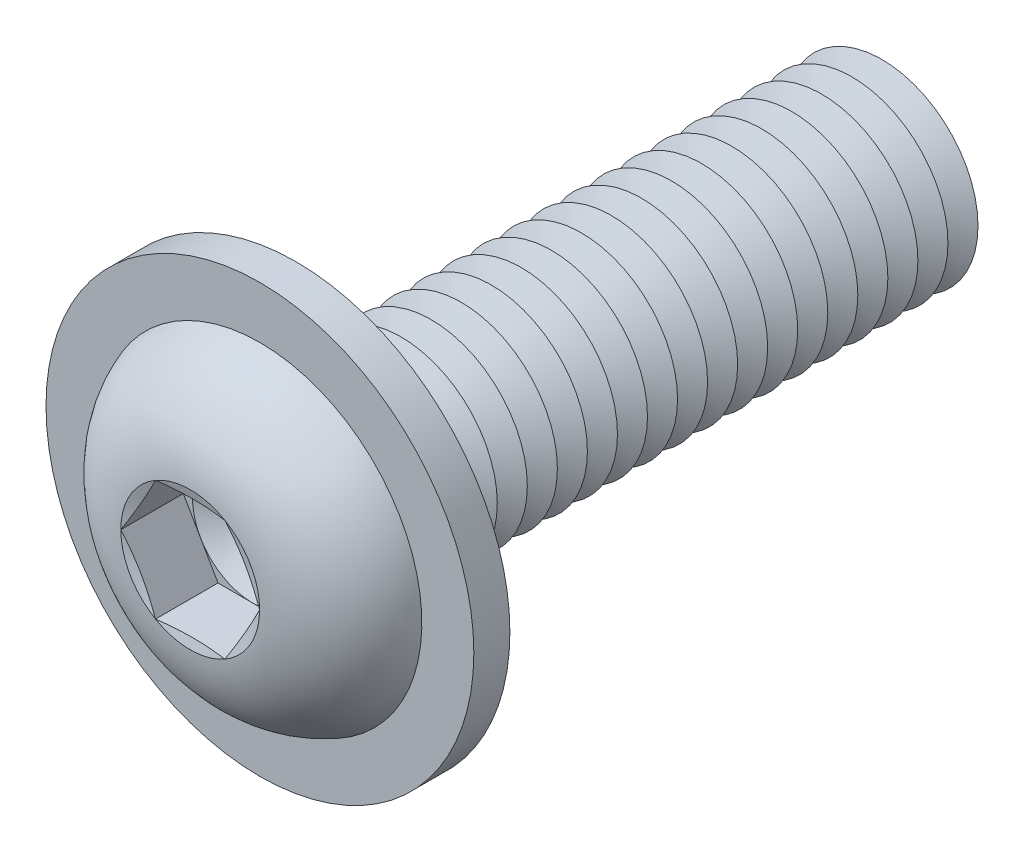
ISO-10303-21;
HEADER;
FILE_DESCRIPTION(('STEP AP214'),'2;1');
FILE_NAME('part.step','',(''),(''),'','','');
FILE_SCHEMA(('AUTOMOTIVE_DESIGN { 1 0 10303 214 1 1 1 1 }'));
ENDSEC;
DATA;
#1=APPLICATION_CONTEXT('core data for automotive mechanical design processes');
#2=APPLICATION_PROTOCOL_DEFINITION('international standard','automotive_design',2000,#1);
#3=PRODUCT_CONTEXT('',#1,'mechanical');
#4=PRODUCT('Part','Part','',(#3));
#5=PRODUCT_RELATED_PRODUCT_CATEGORY('part','',(#4));
#6=PRODUCT_DEFINITION_FORMATION('','',#4);
#7=PRODUCT_DEFINITION_CONTEXT('part definition',#1,'design');
#8=PRODUCT_DEFINITION('design','',#6,#7);
#9=PRODUCT_DEFINITION_SHAPE('','',#8);
#10=(LENGTH_UNIT() NAMED_UNIT(*) SI_UNIT(.MILLI.,.METRE.));
#11=(NAMED_UNIT(*) PLANE_ANGLE_UNIT() SI_UNIT($,.RADIAN.));
#12=(NAMED_UNIT(*) SI_UNIT($,.STERADIAN.) SOLID_ANGLE_UNIT());
#13=UNCERTAINTY_MEASURE_WITH_UNIT(LENGTH_MEASURE(1.E-05),#10,'distance_accuracy_value','');
#14=(GEOMETRIC_REPRESENTATION_CONTEXT(3) GLOBAL_UNCERTAINTY_ASSIGNED_CONTEXT((#13)) GLOBAL_UNIT_ASSIGNED_CONTEXT((#10,
#11,#12)) REPRESENTATION_CONTEXT('',''));
#15=CARTESIAN_POINT('',(0.,0.,0.));
#16=DIRECTION('',(0.,0.,1.));
#17=DIRECTION('',(1.,0.,0.));
#18=AXIS2_PLACEMENT_3D('',#15,#16,#17);
#19=CARTESIAN_POINT('',(0.,0.,-20.625));
#20=DIRECTION('',(0.,0.,1.));
#21=DIRECTION('',(1.,0.,0.));
#22=AXIS2_PLACEMENT_3D('',#19,#20,#21);
#23=CONICAL_SURFACE('',#22,4.00000000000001,1.0471975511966);
#24=CARTESIAN_POINT('',(0.,0.,-21.25));
#25=DIRECTION('',(0.,0.,1.));
#26=DIRECTION('',(1.,0.,0.));
#27=AXIS2_PLACEMENT_3D('',#24,#25,#26);
#28=CIRCLE('',#27,2.91746824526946);
#29=CARTESIAN_POINT('',(2.91746824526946,0.,-21.25));
#30=VERTEX_POINT('',#29);
#31=EDGE_CURVE('E370',#30,#30,#28,.T.);
#32=ORIENTED_EDGE('',*,*,#31,.T.);
#33=EDGE_LOOP('',(#32));
#34=FACE_BOUND('',#33,.T.);
#35=CARTESIAN_POINT('',(0.,0.,-20.625));
#36=DIRECTION('',(0.,0.,1.));
#37=DIRECTION('',(1.,0.,0.));
#38=AXIS2_PLACEMENT_3D('',#35,#36,#37);
#39=CIRCLE('',#38,4.00000000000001);
#40=CARTESIAN_POINT('',(4.00000000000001,0.,-20.625));
#41=VERTEX_POINT('',#40);
#42=EDGE_CURVE('E366',#41,#41,#39,.T.);
#43=ORIENTED_EDGE('',*,*,#42,.F.);
#44=EDGE_LOOP('',(#43));
#45=FACE_BOUND('',#44,.T.);
#46=ADVANCED_FACE('F39',(#34,#45),#23,.T.);
#47=CARTESIAN_POINT('',(0.,0.,-21.25));
#48=DIRECTION('',(0.,0.,-1.));
#49=DIRECTION('',(-1.,0.,0.));
#50=AXIS2_PLACEMENT_3D('',#47,#48,#49);
#51=CONICAL_SURFACE('',#50,2.91746824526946,1.0471975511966);
#52=CARTESIAN_POINT('',(0.,0.,-21.875));
#53=DIRECTION('',(0.,0.,1.));
#54=DIRECTION('',(1.,0.,0.));
#55=AXIS2_PLACEMENT_3D('',#52,#53,#54);
#56=CIRCLE('',#55,4.00000000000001);
#57=CARTESIAN_POINT('',(4.00000000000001,0.,-21.875));
#58=VERTEX_POINT('',#57);
#59=EDGE_CURVE('E374',#58,#58,#56,.T.);
#60=ORIENTED_EDGE('',*,*,#59,.T.);
#61=EDGE_LOOP('',(#60));
#62=FACE_BOUND('',#61,.T.);
#63=ORIENTED_EDGE('',*,*,#31,.F.);
#64=EDGE_LOOP('',(#63));
#65=FACE_BOUND('',#64,.T.);
#66=ADVANCED_FACE('F492',(#62,#65),#51,.T.);
#67=CARTESIAN_POINT('',(0.,4.00000000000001,-25.));
#68=DIRECTION('',(0.,0.,-1.));
#69=DIRECTION('',(-1.,0.,0.));
#70=AXIS2_PLACEMENT_3D('',#67,#68,#69);
#71=PLANE('',#70);
#72=CARTESIAN_POINT('',(0.,0.,-25.));
#73=DIRECTION('',(0.,0.,1.));
#74=DIRECTION('',(1.,0.,0.));
#75=AXIS2_PLACEMENT_3D('',#72,#73,#74);
#76=CIRCLE('',#75,2.91746824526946);
#77=CARTESIAN_POINT('',(2.91746824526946,0.,-25.));
#78=VERTEX_POINT('',#77);
#79=EDGE_CURVE('E394',#78,#78,#76,.T.);
#80=ORIENTED_EDGE('',*,*,#79,.F.);
#81=EDGE_LOOP('',(#80));
#82=FACE_BOUND('',#81,.T.);
#83=ADVANCED_FACE('F498',(#82),#71,.T.);
#84=CARTESIAN_POINT('',(0.,0.,-24.375));
#85=DIRECTION('',(0.,0.,1.));
#86=DIRECTION('',(1.,0.,0.));
#87=AXIS2_PLACEMENT_3D('',#84,#85,#86);
#88=CONICAL_SURFACE('',#87,4.00000000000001,1.0471975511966);
#89=ORIENTED_EDGE('',*,*,#79,.T.);
#90=EDGE_LOOP('',(#89));
#91=FACE_BOUND('',#90,.T.);
#92=CARTESIAN_POINT('',(0.,0.,-24.375));
#93=DIRECTION('',(0.,0.,1.));
#94=DIRECTION('',(1.,0.,0.));
#95=AXIS2_PLACEMENT_3D('',#92,#93,#94);
#96=CIRCLE('',#95,4.00000000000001);
#97=CARTESIAN_POINT('',(4.00000000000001,0.,-24.375));
#98=VERTEX_POINT('',#97);
#99=EDGE_CURVE('E390',#98,#98,#96,.T.);
#100=ORIENTED_EDGE('',*,*,#99,.F.);
#101=EDGE_LOOP('',(#100));
#102=FACE_BOUND('',#101,.T.);
#103=ADVANCED_FACE('F517',(#91,#102),#88,.T.);
#104=CARTESIAN_POINT('',(0.,0.,-23.75));
#105=DIRECTION('',(0.,0.,-1.));
#106=DIRECTION('',(-1.,0.,0.));
#107=AXIS2_PLACEMENT_3D('',#104,#105,#106);
#108=CONICAL_SURFACE('',#107,2.91746824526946,1.0471975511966);
#109=ORIENTED_EDGE('',*,*,#99,.T.);
#110=EDGE_LOOP('',(#109));
#111=FACE_BOUND('',#110,.T.);
#112=CARTESIAN_POINT('',(0.,0.,-23.75));
#113=DIRECTION('',(0.,0.,1.));
#114=DIRECTION('',(1.,0.,0.));
#115=AXIS2_PLACEMENT_3D('',#112,#113,#114);
#116=CIRCLE('',#115,2.91746824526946);
#117=CARTESIAN_POINT('',(2.91746824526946,0.,-23.75));
#118=VERTEX_POINT('',#117);
#119=EDGE_CURVE('E386',#118,#118,#116,.T.);
#120=ORIENTED_EDGE('',*,*,#119,.F.);
#121=EDGE_LOOP('',(#120));
#122=FACE_BOUND('',#121,.T.);
#123=ADVANCED_FACE('F514',(#111,#122),#108,.T.);
#124=CARTESIAN_POINT('',(0.,0.,-23.125));
#125=DIRECTION('',(0.,0.,1.));
#126=DIRECTION('',(1.,0.,0.));
#127=AXIS2_PLACEMENT_3D('',#124,#125,#126);
#128=CONICAL_SURFACE('',#127,4.00000000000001,1.0471975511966);
#129=ORIENTED_EDGE('',*,*,#119,.T.);
#130=EDGE_LOOP('',(#129));
#131=FACE_BOUND('',#130,.T.);
#132=CARTESIAN_POINT('',(0.,0.,-23.125));
#133=DIRECTION('',(0.,0.,1.));
#134=DIRECTION('',(1.,0.,0.));
#135=AXIS2_PLACEMENT_3D('',#132,#133,#134);
#136=CIRCLE('',#135,4.00000000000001);
#137=CARTESIAN_POINT('',(4.00000000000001,0.,-23.125));
#138=VERTEX_POINT('',#137);
#139=EDGE_CURVE('E382',#138,#138,#136,.T.);
#140=ORIENTED_EDGE('',*,*,#139,.F.);
#141=EDGE_LOOP('',(#140));
#142=FACE_BOUND('',#141,.T.);
#143=ADVANCED_FACE('F508',(#131,#142),#128,.T.);
#144=CARTESIAN_POINT('',(0.,0.,-22.5));
#145=DIRECTION('',(0.,0.,-1.));
#146=DIRECTION('',(-1.,0.,0.));
#147=AXIS2_PLACEMENT_3D('',#144,#145,#146);
#148=CONICAL_SURFACE('',#147,2.91746824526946,1.0471975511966);
#149=ORIENTED_EDGE('',*,*,#139,.T.);
#150=EDGE_LOOP('',(#149));
#151=FACE_BOUND('',#150,.T.);
#152=CARTESIAN_POINT('',(0.,0.,-22.5));
#153=DIRECTION('',(0.,0.,1.));
#154=DIRECTION('',(1.,0.,0.));
#155=AXIS2_PLACEMENT_3D('',#152,#153,#154);
#156=CIRCLE('',#155,2.91746824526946);
#157=CARTESIAN_POINT('',(2.91746824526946,0.,-22.5));
#158=VERTEX_POINT('',#157);
#159=EDGE_CURVE('E378',#158,#158,#156,.T.);
#160=ORIENTED_EDGE('',*,*,#159,.F.);
#161=EDGE_LOOP('',(#160));
#162=FACE_BOUND('',#161,.T.);
#163=ADVANCED_FACE('F504',(#151,#162),#148,.T.);
#164=CARTESIAN_POINT('',(0.,0.,-21.875));
#165=DIRECTION('',(0.,0.,1.));
#166=DIRECTION('',(1.,0.,0.));
#167=AXIS2_PLACEMENT_3D('',#164,#165,#166);
#168=CONICAL_SURFACE('',#167,4.00000000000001,1.0471975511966);
#169=ORIENTED_EDGE('',*,*,#159,.T.);
#170=EDGE_LOOP('',(#169));
#171=FACE_BOUND('',#170,.T.);
#172=ORIENTED_EDGE('',*,*,#59,.F.);
#173=EDGE_LOOP('',(#172));
#174=FACE_BOUND('',#173,.T.);
#175=ADVANCED_FACE('F507',(#171,#174),#168,.T.);
#176=CARTESIAN_POINT('',(0.,0.,-19.375));
#177=DIRECTION('',(0.,0.,1.));
#178=DIRECTION('',(1.,0.,0.));
#179=AXIS2_PLACEMENT_3D('',#176,#177,#178);
#180=CONICAL_SURFACE('',#179,4.00000000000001,1.0471975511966);
#181=CARTESIAN_POINT('',(0.,0.,-20.));
#182=DIRECTION('',(0.,0.,1.));
#183=DIRECTION('',(1.,0.,0.));
#184=AXIS2_PLACEMENT_3D('',#181,#182,#183);
#185=CIRCLE('',#184,2.91746824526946);
#186=CARTESIAN_POINT('',(2.91746824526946,0.,-20.));
#187=VERTEX_POINT('',#186);
#188=EDGE_CURVE('E362',#187,#187,#185,.T.);
#189=ORIENTED_EDGE('',*,*,#188,.T.);
#190=EDGE_LOOP('',(#189));
#191=FACE_BOUND('',#190,.T.);
#192=CARTESIAN_POINT('',(0.,0.,-19.375));
#193=DIRECTION('',(0.,0.,1.));
#194=DIRECTION('',(1.,0.,0.));
#195=AXIS2_PLACEMENT_3D('',#192,#193,#194);
#196=CIRCLE('',#195,4.00000000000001);
#197=CARTESIAN_POINT('',(4.00000000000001,0.,-19.375));
#198=VERTEX_POINT('',#197);
#199=EDGE_CURVE('E358',#198,#198,#196,.T.);
#200=ORIENTED_EDGE('',*,*,#199,.F.);
#201=EDGE_LOOP('',(#200));
#202=FACE_BOUND('',#201,.T.);
#203=ADVANCED_FACE('F512',(#191,#202),#180,.T.);
#204=CARTESIAN_POINT('',(0.,0.,-20.));
#205=DIRECTION('',(0.,0.,-1.));
#206=DIRECTION('',(-1.,0.,0.));
#207=AXIS2_PLACEMENT_3D('',#204,#205,#206);
#208=CONICAL_SURFACE('',#207,2.91746824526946,1.0471975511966);
#209=ORIENTED_EDGE('',*,*,#42,.T.);
#210=EDGE_LOOP('',(#209));
#211=FACE_BOUND('',#210,.T.);
#212=ORIENTED_EDGE('',*,*,#188,.F.);
#213=EDGE_LOOP('',(#212));
#214=FACE_BOUND('',#213,.T.);
#215=ADVANCED_FACE('F563',(#211,#214),#208,.T.);
#216=CARTESIAN_POINT('',(0.,0.,-18.125));
#217=DIRECTION('',(0.,0.,1.));
#218=DIRECTION('',(1.,0.,0.));
#219=AXIS2_PLACEMENT_3D('',#216,#217,#218);
#220=CONICAL_SURFACE('',#219,4.00000000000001,1.0471975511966);
#221=CARTESIAN_POINT('',(0.,0.,-18.75));
#222=DIRECTION('',(0.,0.,1.));
#223=DIRECTION('',(1.,0.,0.));
#224=AXIS2_PLACEMENT_3D('',#221,#222,#223);
#225=CIRCLE('',#224,2.91746824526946);
#226=CARTESIAN_POINT('',(2.91746824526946,0.,-18.75));
#227=VERTEX_POINT('',#226);
#228=EDGE_CURVE('E354',#227,#227,#225,.T.);
#229=ORIENTED_EDGE('',*,*,#228,.T.);
#230=EDGE_LOOP('',(#229));
#231=FACE_BOUND('',#230,.T.);
#232=CARTESIAN_POINT('',(0.,0.,-18.125));
#233=DIRECTION('',(0.,0.,1.));
#234=DIRECTION('',(1.,0.,0.));
#235=AXIS2_PLACEMENT_3D('',#232,#233,#234);
#236=CIRCLE('',#235,4.00000000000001);
#237=CARTESIAN_POINT('',(4.00000000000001,0.,-18.125));
#238=VERTEX_POINT('',#237);
#239=EDGE_CURVE('E350',#238,#238,#236,.T.);
#240=ORIENTED_EDGE('',*,*,#239,.F.);
#241=EDGE_LOOP('',(#240));
#242=FACE_BOUND('',#241,.T.);
#243=ADVANCED_FACE('F569',(#231,#242),#220,.T.);
#244=CARTESIAN_POINT('',(0.,0.,-18.75));
#245=DIRECTION('',(0.,0.,-1.));
#246=DIRECTION('',(-1.,0.,0.));
#247=AXIS2_PLACEMENT_3D('',#244,#245,#246);
#248=CONICAL_SURFACE('',#247,2.91746824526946,1.0471975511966);
#249=ORIENTED_EDGE('',*,*,#199,.T.);
#250=EDGE_LOOP('',(#249));
#251=FACE_BOUND('',#250,.T.);
#252=ORIENTED_EDGE('',*,*,#228,.F.);
#253=EDGE_LOOP('',(#252));
#254=FACE_BOUND('',#253,.T.);
#255=ADVANCED_FACE('F576',(#251,#254),#248,.T.);
#256=CARTESIAN_POINT('',(0.,0.,-16.875));
#257=DIRECTION('',(0.,0.,1.));
#258=DIRECTION('',(1.,0.,0.));
#259=AXIS2_PLACEMENT_3D('',#256,#257,#258);
#260=CONICAL_SURFACE('',#259,4.00000000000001,1.0471975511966);
#261=CARTESIAN_POINT('',(0.,0.,-17.5));
#262=DIRECTION('',(0.,0.,1.));
#263=DIRECTION('',(1.,0.,0.));
#264=AXIS2_PLACEMENT_3D('',#261,#262,#263);
#265=CIRCLE('',#264,2.91746824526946);
#266=CARTESIAN_POINT('',(2.91746824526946,0.,-17.5));
#267=VERTEX_POINT('',#266);
#268=EDGE_CURVE('E346',#267,#267,#265,.T.);
#269=ORIENTED_EDGE('',*,*,#268,.T.);
#270=EDGE_LOOP('',(#269));
#271=FACE_BOUND('',#270,.T.);
#272=CARTESIAN_POINT('',(0.,0.,-16.875));
#273=DIRECTION('',(0.,0.,1.));
#274=DIRECTION('',(1.,0.,0.));
#275=AXIS2_PLACEMENT_3D('',#272,#273,#274);
#276=CIRCLE('',#275,4.00000000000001);
#277=CARTESIAN_POINT('',(4.00000000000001,0.,-16.875));
#278=VERTEX_POINT('',#277);
#279=EDGE_CURVE('E342',#278,#278,#276,.T.);
#280=ORIENTED_EDGE('',*,*,#279,.F.);
#281=EDGE_LOOP('',(#280));
#282=FACE_BOUND('',#281,.T.);
#283=ADVANCED_FACE('F583',(#271,#282),#260,.T.);
#284=CARTESIAN_POINT('',(0.,0.,-17.5));
#285=DIRECTION('',(0.,0.,-1.));
#286=DIRECTION('',(-1.,0.,0.));
#287=AXIS2_PLACEMENT_3D('',#284,#285,#286);
#288=CONICAL_SURFACE('',#287,2.91746824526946,1.0471975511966);
#289=ORIENTED_EDGE('',*,*,#239,.T.);
#290=EDGE_LOOP('',(#289));
#291=FACE_BOUND('',#290,.T.);
#292=ORIENTED_EDGE('',*,*,#268,.F.);
#293=EDGE_LOOP('',(#292));
#294=FACE_BOUND('',#293,.T.);
#295=ADVANCED_FACE('F590',(#291,#294),#288,.T.);
#296=CARTESIAN_POINT('',(0.,0.,-15.625));
#297=DIRECTION('',(0.,0.,1.));
#298=DIRECTION('',(1.,0.,0.));
#299=AXIS2_PLACEMENT_3D('',#296,#297,#298);
#300=CONICAL_SURFACE('',#299,4.00000000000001,1.0471975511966);
#301=CARTESIAN_POINT('',(0.,0.,-16.25));
#302=DIRECTION('',(0.,0.,1.));
#303=DIRECTION('',(1.,0.,0.));
#304=AXIS2_PLACEMENT_3D('',#301,#302,#303);
#305=CIRCLE('',#304,2.91746824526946);
#306=CARTESIAN_POINT('',(2.91746824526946,0.,-16.25));
#307=VERTEX_POINT('',#306);
#308=EDGE_CURVE('E338',#307,#307,#305,.T.);
#309=ORIENTED_EDGE('',*,*,#308,.T.);
#310=EDGE_LOOP('',(#309));
#311=FACE_BOUND('',#310,.T.);
#312=CARTESIAN_POINT('',(0.,0.,-15.625));
#313=DIRECTION('',(0.,0.,1.));
#314=DIRECTION('',(1.,0.,0.));
#315=AXIS2_PLACEMENT_3D('',#312,#313,#314);
#316=CIRCLE('',#315,4.00000000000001);
#317=CARTESIAN_POINT('',(4.00000000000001,0.,-15.625));
#318=VERTEX_POINT('',#317);
#319=EDGE_CURVE('E334',#318,#318,#316,.T.);
#320=ORIENTED_EDGE('',*,*,#319,.F.);
#321=EDGE_LOOP('',(#320));
#322=FACE_BOUND('',#321,.T.);
#323=ADVANCED_FACE('F597',(#311,#322),#300,.T.);
#324=CARTESIAN_POINT('',(0.,0.,-16.25));
#325=DIRECTION('',(0.,0.,-1.));
#326=DIRECTION('',(-1.,0.,0.));
#327=AXIS2_PLACEMENT_3D('',#324,#325,#326);
#328=CONICAL_SURFACE('',#327,2.91746824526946,1.0471975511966);
#329=ORIENTED_EDGE('',*,*,#279,.T.);
#330=EDGE_LOOP('',(#329));
#331=FACE_BOUND('',#330,.T.);
#332=ORIENTED_EDGE('',*,*,#308,.F.);
#333=EDGE_LOOP('',(#332));
#334=FACE_BOUND('',#333,.T.);
#335=ADVANCED_FACE('F604',(#331,#334),#328,.T.);
#336=CARTESIAN_POINT('',(0.,0.,-14.375));
#337=DIRECTION('',(0.,0.,1.));
#338=DIRECTION('',(1.,0.,0.));
#339=AXIS2_PLACEMENT_3D('',#336,#337,#338);
#340=CONICAL_SURFACE('',#339,4.00000000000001,1.0471975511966);
#341=CARTESIAN_POINT('',(0.,0.,-15.));
#342=DIRECTION('',(0.,0.,1.));
#343=DIRECTION('',(1.,0.,0.));
#344=AXIS2_PLACEMENT_3D('',#341,#342,#343);
#345=CIRCLE('',#344,2.91746824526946);
#346=CARTESIAN_POINT('',(2.91746824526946,0.,-15.));
#347=VERTEX_POINT('',#346);
#348=EDGE_CURVE('E330',#347,#347,#345,.T.);
#349=ORIENTED_EDGE('',*,*,#348,.T.);
#350=EDGE_LOOP('',(#349));
#351=FACE_BOUND('',#350,.T.);
#352=CARTESIAN_POINT('',(0.,0.,-14.375));
#353=DIRECTION('',(0.,0.,1.));
#354=DIRECTION('',(1.,0.,0.));
#355=AXIS2_PLACEMENT_3D('',#352,#353,#354);
#356=CIRCLE('',#355,4.00000000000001);
#357=CARTESIAN_POINT('',(4.00000000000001,0.,-14.375));
#358=VERTEX_POINT('',#357);
#359=EDGE_CURVE('E326',#358,#358,#356,.T.);
#360=ORIENTED_EDGE('',*,*,#359,.F.);
#361=EDGE_LOOP('',(#360));
#362=FACE_BOUND('',#361,.T.);
#363=ADVANCED_FACE('F611',(#351,#362),#340,.T.);
#364=CARTESIAN_POINT('',(0.,0.,-15.));
#365=DIRECTION('',(0.,0.,-1.));
#366=DIRECTION('',(-1.,0.,0.));
#367=AXIS2_PLACEMENT_3D('',#364,#365,#366);
#368=CONICAL_SURFACE('',#367,2.91746824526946,1.0471975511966);
#369=ORIENTED_EDGE('',*,*,#319,.T.);
#370=EDGE_LOOP('',(#369));
#371=FACE_BOUND('',#370,.T.);
#372=ORIENTED_EDGE('',*,*,#348,.F.);
#373=EDGE_LOOP('',(#372));
#374=FACE_BOUND('',#373,.T.);
#375=ADVANCED_FACE('F618',(#371,#374),#368,.T.);
#376=CARTESIAN_POINT('',(0.,0.,-13.125));
#377=DIRECTION('',(0.,0.,1.));
#378=DIRECTION('',(1.,0.,0.));
#379=AXIS2_PLACEMENT_3D('',#376,#377,#378);
#380=CONICAL_SURFACE('',#379,4.00000000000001,1.0471975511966);
#381=CARTESIAN_POINT('',(0.,0.,-13.75));
#382=DIRECTION('',(0.,0.,1.));
#383=DIRECTION('',(1.,0.,0.));
#384=AXIS2_PLACEMENT_3D('',#381,#382,#383);
#385=CIRCLE('',#384,2.91746824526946);
#386=CARTESIAN_POINT('',(2.91746824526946,0.,-13.75));
#387=VERTEX_POINT('',#386);
#388=EDGE_CURVE('E322',#387,#387,#385,.T.);
#389=ORIENTED_EDGE('',*,*,#388,.T.);
#390=EDGE_LOOP('',(#389));
#391=FACE_BOUND('',#390,.T.);
#392=CARTESIAN_POINT('',(0.,0.,-13.125));
#393=DIRECTION('',(0.,0.,1.));
#394=DIRECTION('',(1.,0.,0.));
#395=AXIS2_PLACEMENT_3D('',#392,#393,#394);
#396=CIRCLE('',#395,4.00000000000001);
#397=CARTESIAN_POINT('',(4.00000000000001,0.,-13.125));
#398=VERTEX_POINT('',#397);
#399=EDGE_CURVE('E318',#398,#398,#396,.T.);
#400=ORIENTED_EDGE('',*,*,#399,.F.);
#401=EDGE_LOOP('',(#400));
#402=FACE_BOUND('',#401,.T.);
#403=ADVANCED_FACE('F625',(#391,#402),#380,.T.);
#404=CARTESIAN_POINT('',(0.,0.,-13.75));
#405=DIRECTION('',(0.,0.,-1.));
#406=DIRECTION('',(-1.,0.,0.));
#407=AXIS2_PLACEMENT_3D('',#404,#405,#406);
#408=CONICAL_SURFACE('',#407,2.91746824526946,1.0471975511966);
#409=ORIENTED_EDGE('',*,*,#359,.T.);
#410=EDGE_LOOP('',(#409));
#411=FACE_BOUND('',#410,.T.);
#412=ORIENTED_EDGE('',*,*,#388,.F.);
#413=EDGE_LOOP('',(#412));
#414=FACE_BOUND('',#413,.T.);
#415=ADVANCED_FACE('F632',(#411,#414),#408,.T.);
#416=CARTESIAN_POINT('',(0.,0.,-11.875));
#417=DIRECTION('',(0.,0.,1.));
#418=DIRECTION('',(1.,0.,0.));
#419=AXIS2_PLACEMENT_3D('',#416,#417,#418);
#420=CONICAL_SURFACE('',#419,4.00000000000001,1.0471975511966);
#421=CARTESIAN_POINT('',(0.,0.,-12.5));
#422=DIRECTION('',(0.,0.,1.));
#423=DIRECTION('',(1.,0.,0.));
#424=AXIS2_PLACEMENT_3D('',#421,#422,#423);
#425=CIRCLE('',#424,2.91746824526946);
#426=CARTESIAN_POINT('',(2.91746824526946,0.,-12.5));
#427=VERTEX_POINT('',#426);
#428=EDGE_CURVE('E314',#427,#427,#425,.T.);
#429=ORIENTED_EDGE('',*,*,#428,.T.);
#430=EDGE_LOOP('',(#429));
#431=FACE_BOUND('',#430,.T.);
#432=CARTESIAN_POINT('',(0.,0.,-11.875));
#433=DIRECTION('',(0.,0.,1.));
#434=DIRECTION('',(1.,0.,0.));
#435=AXIS2_PLACEMENT_3D('',#432,#433,#434);
#436=CIRCLE('',#435,4.00000000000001);
#437=CARTESIAN_POINT('',(4.00000000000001,0.,-11.875));
#438=VERTEX_POINT('',#437);
#439=EDGE_CURVE('E310',#438,#438,#436,.T.);
#440=ORIENTED_EDGE('',*,*,#439,.F.);
#441=EDGE_LOOP('',(#440));
#442=FACE_BOUND('',#441,.T.);
#443=ADVANCED_FACE('F639',(#431,#442),#420,.T.);
#444=CARTESIAN_POINT('',(0.,0.,-12.5));
#445=DIRECTION('',(0.,0.,-1.));
#446=DIRECTION('',(-1.,0.,0.));
#447=AXIS2_PLACEMENT_3D('',#444,#445,#446);
#448=CONICAL_SURFACE('',#447,2.91746824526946,1.0471975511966);
#449=ORIENTED_EDGE('',*,*,#399,.T.);
#450=EDGE_LOOP('',(#449));
#451=FACE_BOUND('',#450,.T.);
#452=ORIENTED_EDGE('',*,*,#428,.F.);
#453=EDGE_LOOP('',(#452));
#454=FACE_BOUND('',#453,.T.);
#455=ADVANCED_FACE('F646',(#451,#454),#448,.T.);
#456=CARTESIAN_POINT('',(0.,0.,-10.625));
#457=DIRECTION('',(0.,0.,1.));
#458=DIRECTION('',(1.,0.,0.));
#459=AXIS2_PLACEMENT_3D('',#456,#457,#458);
#460=CONICAL_SURFACE('',#459,4.00000000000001,1.0471975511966);
#461=CARTESIAN_POINT('',(0.,0.,-11.25));
#462=DIRECTION('',(0.,0.,1.));
#463=DIRECTION('',(1.,0.,0.));
#464=AXIS2_PLACEMENT_3D('',#461,#462,#463);
#465=CIRCLE('',#464,2.91746824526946);
#466=CARTESIAN_POINT('',(2.91746824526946,0.,-11.25));
#467=VERTEX_POINT('',#466);
#468=EDGE_CURVE('E306',#467,#467,#465,.T.);
#469=ORIENTED_EDGE('',*,*,#468,.T.);
#470=EDGE_LOOP('',(#469));
#471=FACE_BOUND('',#470,.T.);
#472=CARTESIAN_POINT('',(0.,0.,-10.625));
#473=DIRECTION('',(0.,0.,1.));
#474=DIRECTION('',(1.,0.,0.));
#475=AXIS2_PLACEMENT_3D('',#472,#473,#474);
#476=CIRCLE('',#475,4.00000000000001);
#477=CARTESIAN_POINT('',(4.00000000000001,0.,-10.625));
#478=VERTEX_POINT('',#477);
#479=EDGE_CURVE('E302',#478,#478,#476,.T.);
#480=ORIENTED_EDGE('',*,*,#479,.F.);
#481=EDGE_LOOP('',(#480));
#482=FACE_BOUND('',#481,.T.);
#483=ADVANCED_FACE('F653',(#471,#482),#460,.T.);
#484=CARTESIAN_POINT('',(0.,0.,-11.25));
#485=DIRECTION('',(0.,0.,-1.));
#486=DIRECTION('',(-1.,0.,0.));
#487=AXIS2_PLACEMENT_3D('',#484,#485,#486);
#488=CONICAL_SURFACE('',#487,2.91746824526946,1.0471975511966);
#489=ORIENTED_EDGE('',*,*,#439,.T.);
#490=EDGE_LOOP('',(#489));
#491=FACE_BOUND('',#490,.T.);
#492=ORIENTED_EDGE('',*,*,#468,.F.);
#493=EDGE_LOOP('',(#492));
#494=FACE_BOUND('',#493,.T.);
#495=ADVANCED_FACE('F660',(#491,#494),#488,.T.);
#496=CARTESIAN_POINT('',(0.,0.,-9.375));
#497=DIRECTION('',(0.,0.,1.));
#498=DIRECTION('',(1.,0.,0.));
#499=AXIS2_PLACEMENT_3D('',#496,#497,#498);
#500=CONICAL_SURFACE('',#499,4.00000000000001,1.0471975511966);
#501=CARTESIAN_POINT('',(0.,0.,-10.));
#502=DIRECTION('',(0.,0.,1.));
#503=DIRECTION('',(1.,0.,0.));
#504=AXIS2_PLACEMENT_3D('',#501,#502,#503);
#505=CIRCLE('',#504,2.91746824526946);
#506=CARTESIAN_POINT('',(2.91746824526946,0.,-10.));
#507=VERTEX_POINT('',#506);
#508=EDGE_CURVE('E298',#507,#507,#505,.T.);
#509=ORIENTED_EDGE('',*,*,#508,.T.);
#510=EDGE_LOOP('',(#509));
#511=FACE_BOUND('',#510,.T.);
#512=CARTESIAN_POINT('',(0.,0.,-9.375));
#513=DIRECTION('',(0.,0.,1.));
#514=DIRECTION('',(1.,0.,0.));
#515=AXIS2_PLACEMENT_3D('',#512,#513,#514);
#516=CIRCLE('',#515,4.00000000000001);
#517=CARTESIAN_POINT('',(4.00000000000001,0.,-9.375));
#518=VERTEX_POINT('',#517);
#519=EDGE_CURVE('E294',#518,#518,#516,.T.);
#520=ORIENTED_EDGE('',*,*,#519,.F.);
#521=EDGE_LOOP('',(#520));
#522=FACE_BOUND('',#521,.T.);
#523=ADVANCED_FACE('F667',(#511,#522),#500,.T.);
#524=CARTESIAN_POINT('',(0.,0.,-10.));
#525=DIRECTION('',(0.,0.,-1.));
#526=DIRECTION('',(-1.,0.,0.));
#527=AXIS2_PLACEMENT_3D('',#524,#525,#526);
#528=CONICAL_SURFACE('',#527,2.91746824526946,1.0471975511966);
#529=ORIENTED_EDGE('',*,*,#479,.T.);
#530=EDGE_LOOP('',(#529));
#531=FACE_BOUND('',#530,.T.);
#532=ORIENTED_EDGE('',*,*,#508,.F.);
#533=EDGE_LOOP('',(#532));
#534=FACE_BOUND('',#533,.T.);
#535=ADVANCED_FACE('F674',(#531,#534),#528,.T.);
#536=CARTESIAN_POINT('',(0.,0.,-8.125));
#537=DIRECTION('',(0.,0.,1.));
#538=DIRECTION('',(1.,0.,0.));
#539=AXIS2_PLACEMENT_3D('',#536,#537,#538);
#540=CONICAL_SURFACE('',#539,4.00000000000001,1.0471975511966);
#541=CARTESIAN_POINT('',(0.,0.,-8.75));
#542=DIRECTION('',(0.,0.,1.));
#543=DIRECTION('',(1.,0.,0.));
#544=AXIS2_PLACEMENT_3D('',#541,#542,#543);
#545=CIRCLE('',#544,2.91746824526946);
#546=CARTESIAN_POINT('',(2.91746824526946,0.,-8.75));
#547=VERTEX_POINT('',#546);
#548=EDGE_CURVE('E290',#547,#547,#545,.T.);
#549=ORIENTED_EDGE('',*,*,#548,.T.);
#550=EDGE_LOOP('',(#549));
#551=FACE_BOUND('',#550,.T.);
#552=CARTESIAN_POINT('',(0.,0.,-8.125));
#553=DIRECTION('',(0.,0.,1.));
#554=DIRECTION('',(1.,0.,0.));
#555=AXIS2_PLACEMENT_3D('',#552,#553,#554);
#556=CIRCLE('',#555,4.00000000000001);
#557=CARTESIAN_POINT('',(4.00000000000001,0.,-8.125));
#558=VERTEX_POINT('',#557);
#559=EDGE_CURVE('E286',#558,#558,#556,.T.);
#560=ORIENTED_EDGE('',*,*,#559,.F.);
#561=EDGE_LOOP('',(#560));
#562=FACE_BOUND('',#561,.T.);
#563=ADVANCED_FACE('F681',(#551,#562),#540,.T.);
#564=CARTESIAN_POINT('',(0.,0.,-8.75));
#565=DIRECTION('',(0.,0.,-1.));
#566=DIRECTION('',(-1.,0.,0.));
#567=AXIS2_PLACEMENT_3D('',#564,#565,#566);
#568=CONICAL_SURFACE('',#567,2.91746824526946,1.0471975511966);
#569=ORIENTED_EDGE('',*,*,#519,.T.);
#570=EDGE_LOOP('',(#569));
#571=FACE_BOUND('',#570,.T.);
#572=ORIENTED_EDGE('',*,*,#548,.F.);
#573=EDGE_LOOP('',(#572));
#574=FACE_BOUND('',#573,.T.);
#575=ADVANCED_FACE('F688',(#571,#574),#568,.T.);
#576=CARTESIAN_POINT('',(0.,0.,-6.875));
#577=DIRECTION('',(0.,0.,1.));
#578=DIRECTION('',(1.,0.,0.));
#579=AXIS2_PLACEMENT_3D('',#576,#577,#578);
#580=CONICAL_SURFACE('',#579,4.00000000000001,1.0471975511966);
#581=CARTESIAN_POINT('',(0.,0.,-7.5));
#582=DIRECTION('',(0.,0.,1.));
#583=DIRECTION('',(1.,0.,0.));
#584=AXIS2_PLACEMENT_3D('',#581,#582,#583);
#585=CIRCLE('',#584,2.91746824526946);
#586=CARTESIAN_POINT('',(2.91746824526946,0.,-7.5));
#587=VERTEX_POINT('',#586);
#588=EDGE_CURVE('E282',#587,#587,#585,.T.);
#589=ORIENTED_EDGE('',*,*,#588,.T.);
#590=EDGE_LOOP('',(#589));
#591=FACE_BOUND('',#590,.T.);
#592=CARTESIAN_POINT('',(0.,0.,-6.875));
#593=DIRECTION('',(0.,0.,1.));
#594=DIRECTION('',(1.,0.,0.));
#595=AXIS2_PLACEMENT_3D('',#592,#593,#594);
#596=CIRCLE('',#595,4.00000000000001);
#597=CARTESIAN_POINT('',(4.00000000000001,0.,-6.875));
#598=VERTEX_POINT('',#597);
#599=EDGE_CURVE('E278',#598,#598,#596,.T.);
#600=ORIENTED_EDGE('',*,*,#599,.F.);
#601=EDGE_LOOP('',(#600));
#602=FACE_BOUND('',#601,.T.);
#603=ADVANCED_FACE('F695',(#591,#602),#580,.T.);
#604=CARTESIAN_POINT('',(0.,0.,-7.5));
#605=DIRECTION('',(0.,0.,-1.));
#606=DIRECTION('',(-1.,0.,0.));
#607=AXIS2_PLACEMENT_3D('',#604,#605,#606);
#608=CONICAL_SURFACE('',#607,2.91746824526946,1.0471975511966);
#609=ORIENTED_EDGE('',*,*,#559,.T.);
#610=EDGE_LOOP('',(#609));
#611=FACE_BOUND('',#610,.T.);
#612=ORIENTED_EDGE('',*,*,#588,.F.);
#613=EDGE_LOOP('',(#612));
#614=FACE_BOUND('',#613,.T.);
#615=ADVANCED_FACE('F702',(#611,#614),#608,.T.);
#616=CARTESIAN_POINT('',(0.,0.,-5.625));
#617=DIRECTION('',(0.,0.,1.));
#618=DIRECTION('',(1.,0.,0.));
#619=AXIS2_PLACEMENT_3D('',#616,#617,#618);
#620=CONICAL_SURFACE('',#619,4.00000000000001,1.0471975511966);
#621=CARTESIAN_POINT('',(0.,0.,-6.25));
#622=DIRECTION('',(0.,0.,1.));
#623=DIRECTION('',(1.,0.,0.));
#624=AXIS2_PLACEMENT_3D('',#621,#622,#623);
#625=CIRCLE('',#624,2.91746824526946);
#626=CARTESIAN_POINT('',(2.91746824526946,0.,-6.25));
#627=VERTEX_POINT('',#626);
#628=EDGE_CURVE('E274',#627,#627,#625,.T.);
#629=ORIENTED_EDGE('',*,*,#628,.T.);
#630=EDGE_LOOP('',(#629));
#631=FACE_BOUND('',#630,.T.);
#632=CARTESIAN_POINT('',(0.,0.,-5.625));
#633=DIRECTION('',(0.,0.,1.));
#634=DIRECTION('',(1.,0.,0.));
#635=AXIS2_PLACEMENT_3D('',#632,#633,#634);
#636=CIRCLE('',#635,4.00000000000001);
#637=CARTESIAN_POINT('',(4.00000000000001,0.,-5.625));
#638=VERTEX_POINT('',#637);
#639=EDGE_CURVE('E270',#638,#638,#636,.T.);
#640=ORIENTED_EDGE('',*,*,#639,.F.);
#641=EDGE_LOOP('',(#640));
#642=FACE_BOUND('',#641,.T.);
#643=ADVANCED_FACE('F709',(#631,#642),#620,.T.);
#644=CARTESIAN_POINT('',(0.,0.,-6.25));
#645=DIRECTION('',(0.,0.,-1.));
#646=DIRECTION('',(-1.,0.,0.));
#647=AXIS2_PLACEMENT_3D('',#644,#645,#646);
#648=CONICAL_SURFACE('',#647,2.91746824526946,1.0471975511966);
#649=ORIENTED_EDGE('',*,*,#599,.T.);
#650=EDGE_LOOP('',(#649));
#651=FACE_BOUND('',#650,.T.);
#652=ORIENTED_EDGE('',*,*,#628,.F.);
#653=EDGE_LOOP('',(#652));
#654=FACE_BOUND('',#653,.T.);
#655=ADVANCED_FACE('F716',(#651,#654),#648,.T.);
#656=CARTESIAN_POINT('',(0.,0.,-4.375));
#657=DIRECTION('',(0.,0.,1.));
#658=DIRECTION('',(1.,0.,0.));
#659=AXIS2_PLACEMENT_3D('',#656,#657,#658);
#660=CONICAL_SURFACE('',#659,4.00000000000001,1.0471975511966);
#661=CARTESIAN_POINT('',(0.,0.,-5.));
#662=DIRECTION('',(0.,0.,1.));
#663=DIRECTION('',(1.,0.,0.));
#664=AXIS2_PLACEMENT_3D('',#661,#662,#663);
#665=CIRCLE('',#664,2.91746824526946);
#666=CARTESIAN_POINT('',(2.91746824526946,0.,-5.));
#667=VERTEX_POINT('',#666);
#668=EDGE_CURVE('E266',#667,#667,#665,.T.);
#669=ORIENTED_EDGE('',*,*,#668,.T.);
#670=EDGE_LOOP('',(#669));
#671=FACE_BOUND('',#670,.T.);
#672=CARTESIAN_POINT('',(0.,0.,-4.375));
#673=DIRECTION('',(0.,0.,1.));
#674=DIRECTION('',(1.,0.,0.));
#675=AXIS2_PLACEMENT_3D('',#672,#673,#674);
#676=CIRCLE('',#675,4.00000000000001);
#677=CARTESIAN_POINT('',(4.00000000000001,0.,-4.375));
#678=VERTEX_POINT('',#677);
#679=EDGE_CURVE('E262',#678,#678,#676,.T.);
#680=ORIENTED_EDGE('',*,*,#679,.F.);
#681=EDGE_LOOP('',(#680));
#682=FACE_BOUND('',#681,.T.);
#683=ADVANCED_FACE('F723',(#671,#682),#660,.T.);
#684=CARTESIAN_POINT('',(0.,0.,-5.));
#685=DIRECTION('',(0.,0.,-1.));
#686=DIRECTION('',(-1.,0.,0.));
#687=AXIS2_PLACEMENT_3D('',#684,#685,#686);
#688=CONICAL_SURFACE('',#687,2.91746824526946,1.0471975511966);
#689=ORIENTED_EDGE('',*,*,#639,.T.);
#690=EDGE_LOOP('',(#689));
#691=FACE_BOUND('',#690,.T.);
#692=ORIENTED_EDGE('',*,*,#668,.F.);
#693=EDGE_LOOP('',(#692));
#694=FACE_BOUND('',#693,.T.);
#695=ADVANCED_FACE('F730',(#691,#694),#688,.T.);
#696=CARTESIAN_POINT('',(0.,0.,-3.125));
#697=DIRECTION('',(0.,0.,1.));
#698=DIRECTION('',(1.,0.,0.));
#699=AXIS2_PLACEMENT_3D('',#696,#697,#698);
#700=CONICAL_SURFACE('',#699,4.00000000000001,1.0471975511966);
#701=CARTESIAN_POINT('',(0.,0.,-3.75));
#702=DIRECTION('',(0.,0.,1.));
#703=DIRECTION('',(1.,0.,0.));
#704=AXIS2_PLACEMENT_3D('',#701,#702,#703);
#705=CIRCLE('',#704,2.91746824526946);
#706=CARTESIAN_POINT('',(2.91746824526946,0.,-3.75));
#707=VERTEX_POINT('',#706);
#708=EDGE_CURVE('E258',#707,#707,#705,.T.);
#709=ORIENTED_EDGE('',*,*,#708,.T.);
#710=EDGE_LOOP('',(#709));
#711=FACE_BOUND('',#710,.T.);
#712=CARTESIAN_POINT('',(0.,0.,-3.125));
#713=DIRECTION('',(0.,0.,1.));
#714=DIRECTION('',(1.,0.,0.));
#715=AXIS2_PLACEMENT_3D('',#712,#713,#714);
#716=CIRCLE('',#715,4.00000000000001);
#717=CARTESIAN_POINT('',(4.00000000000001,0.,-3.125));
#718=VERTEX_POINT('',#717);
#719=EDGE_CURVE('E254',#718,#718,#716,.T.);
#720=ORIENTED_EDGE('',*,*,#719,.F.);
#721=EDGE_LOOP('',(#720));
#722=FACE_BOUND('',#721,.T.);
#723=ADVANCED_FACE('F737',(#711,#722),#700,.T.);
#724=CARTESIAN_POINT('',(0.,0.,-3.75));
#725=DIRECTION('',(0.,0.,-1.));
#726=DIRECTION('',(-1.,0.,0.));
#727=AXIS2_PLACEMENT_3D('',#724,#725,#726);
#728=CONICAL_SURFACE('',#727,2.91746824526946,1.0471975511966);
#729=ORIENTED_EDGE('',*,*,#679,.T.);
#730=EDGE_LOOP('',(#729));
#731=FACE_BOUND('',#730,.T.);
#732=ORIENTED_EDGE('',*,*,#708,.F.);
#733=EDGE_LOOP('',(#732));
#734=FACE_BOUND('',#733,.T.);
#735=ADVANCED_FACE('F744',(#731,#734),#728,.T.);
#736=CARTESIAN_POINT('',(0.,0.,-1.875));
#737=DIRECTION('',(0.,0.,1.));
#738=DIRECTION('',(1.,0.,0.));
#739=AXIS2_PLACEMENT_3D('',#736,#737,#738);
#740=CONICAL_SURFACE('',#739,4.00000000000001,1.0471975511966);
#741=CARTESIAN_POINT('',(0.,0.,-2.5));
#742=DIRECTION('',(0.,0.,1.));
#743=DIRECTION('',(1.,0.,0.));
#744=AXIS2_PLACEMENT_3D('',#741,#742,#743);
#745=CIRCLE('',#744,2.91746824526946);
#746=CARTESIAN_POINT('',(2.91746824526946,0.,-2.5));
#747=VERTEX_POINT('',#746);
#748=EDGE_CURVE('E250',#747,#747,#745,.T.);
#749=ORIENTED_EDGE('',*,*,#748,.T.);
#750=EDGE_LOOP('',(#749));
#751=FACE_BOUND('',#750,.T.);
#752=CARTESIAN_POINT('',(0.,0.,-1.875));
#753=DIRECTION('',(0.,0.,1.));
#754=DIRECTION('',(1.,0.,0.));
#755=AXIS2_PLACEMENT_3D('',#752,#753,#754);
#756=CIRCLE('',#755,4.00000000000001);
#757=CARTESIAN_POINT('',(4.00000000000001,0.,-1.875));
#758=VERTEX_POINT('',#757);
#759=EDGE_CURVE('E242',#758,#758,#756,.T.);
#760=ORIENTED_EDGE('',*,*,#759,.F.);
#761=EDGE_LOOP('',(#760));
#762=FACE_BOUND('',#761,.T.);
#763=ADVANCED_FACE('F751',(#751,#762),#740,.T.);
#764=CARTESIAN_POINT('',(0.,0.,-2.5));
#765=DIRECTION('',(0.,0.,-1.));
#766=DIRECTION('',(-1.,0.,0.));
#767=AXIS2_PLACEMENT_3D('',#764,#765,#766);
#768=CONICAL_SURFACE('',#767,2.91746824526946,1.0471975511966);
#769=ORIENTED_EDGE('',*,*,#719,.T.);
#770=EDGE_LOOP('',(#769));
#771=FACE_BOUND('',#770,.T.);
#772=ORIENTED_EDGE('',*,*,#748,.F.);
#773=EDGE_LOOP('',(#772));
#774=FACE_BOUND('',#773,.T.);
#775=ADVANCED_FACE('F758',(#771,#774),#768,.T.);
#776=CARTESIAN_POINT('',(0.,0.,-0.625000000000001));
#777=DIRECTION('',(0.,0.,1.));
#778=DIRECTION('',(1.,0.,0.));
#779=AXIS2_PLACEMENT_3D('',#776,#777,#778);
#780=CONICAL_SURFACE('',#779,4.00000000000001,1.0471975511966);
#781=CARTESIAN_POINT('',(0.,0.,-1.25));
#782=DIRECTION('',(0.,0.,1.));
#783=DIRECTION('',(1.,0.,0.));
#784=AXIS2_PLACEMENT_3D('',#781,#782,#783);
#785=CIRCLE('',#784,2.91746824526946);
#786=CARTESIAN_POINT('',(2.91746824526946,0.,-1.25));
#787=VERTEX_POINT('',#786);
#788=EDGE_CURVE('E231',#787,#787,#785,.T.);
#789=ORIENTED_EDGE('',*,*,#788,.T.);
#790=EDGE_LOOP('',(#789));
#791=FACE_BOUND('',#790,.T.);
#792=CARTESIAN_POINT('',(0.,0.,-0.625000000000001));
#793=DIRECTION('',(0.,0.,1.));
#794=DIRECTION('',(1.,0.,0.));
#795=AXIS2_PLACEMENT_3D('',#792,#793,#794);
#796=CIRCLE('',#795,4.00000000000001);
#797=CARTESIAN_POINT('',(4.00000000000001,0.,-0.625000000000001));
#798=VERTEX_POINT('',#797);
#799=EDGE_CURVE('E246',#798,#798,#796,.T.);
#800=ORIENTED_EDGE('',*,*,#799,.F.);
#801=EDGE_LOOP('',(#800));
#802=FACE_BOUND('',#801,.T.);
#803=ADVANCED_FACE('F765',(#791,#802),#780,.T.);
#804=CARTESIAN_POINT('',(0.,0.,-1.25));
#805=DIRECTION('',(0.,0.,-1.));
#806=DIRECTION('',(-1.,0.,0.));
#807=AXIS2_PLACEMENT_3D('',#804,#805,#806);
#808=CONICAL_SURFACE('',#807,2.91746824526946,1.0471975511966);
#809=ORIENTED_EDGE('',*,*,#759,.T.);
#810=EDGE_LOOP('',(#809));
#811=FACE_BOUND('',#810,.T.);
#812=ORIENTED_EDGE('',*,*,#788,.F.);
#813=EDGE_LOOP('',(#812));
#814=FACE_BOUND('',#813,.T.);
#815=ADVANCED_FACE('F220',(#811,#814),#808,.T.);
#816=CARTESIAN_POINT('',(0.,4.,0.));
#817=DIRECTION('',(0.,0.,-1.));
#818=DIRECTION('',(-1.,0.,0.));
#819=AXIS2_PLACEMENT_3D('',#816,#817,#818);
#820=PLANE('',#819);
#821=CARTESIAN_POINT('',(0.,0.,0.));
#822=DIRECTION('',(0.,0.,-1.));
#823=DIRECTION('',(-1.,0.,0.));
#824=AXIS2_PLACEMENT_3D('',#821,#822,#823);
#825=CIRCLE('',#824,4.62500000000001);
#826=CARTESIAN_POINT('',(-4.62500000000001,0.,0.));
#827=VERTEX_POINT('',#826);
#828=EDGE_CURVE('E403',#827,#827,#825,.F.);
#829=ORIENTED_EDGE('',*,*,#828,.T.);
#830=EDGE_LOOP('',(#829));
#831=FACE_BOUND('',#830,.T.);
#832=CARTESIAN_POINT('',(0.,0.,0.));
#833=DIRECTION('',(0.,0.,-1.));
#834=DIRECTION('',(0.,1.,0.));
#835=AXIS2_PLACEMENT_3D('',#832,#833,#834);
#836=CIRCLE('',#835,8.9);
#837=CARTESIAN_POINT('',(0.,8.9,0.));
#838=VERTEX_POINT('',#837);
#839=EDGE_CURVE('E1150',#838,#838,#836,.T.);
#840=ORIENTED_EDGE('',*,*,#839,.T.);
#841=EDGE_LOOP('',(#840));
#842=FACE_BOUND('',#841,.T.);
#843=ADVANCED_FACE('F777',(#831,#842),#820,.T.);
#844=CARTESIAN_POINT('',(0.,0.,-0.625000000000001));
#845=DIRECTION('',(0.,0.,-1.));
#846=DIRECTION('',(-1.,0.,0.));
#847=AXIS2_PLACEMENT_3D('',#844,#845,#846);
#848=TOROIDAL_SURFACE('',#847,4.62500000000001,0.625);
#849=ORIENTED_EDGE('',*,*,#828,.F.);
#850=EDGE_LOOP('',(#849));
#851=FACE_BOUND('',#850,.T.);
#852=ORIENTED_EDGE('',*,*,#799,.T.);
#853=EDGE_LOOP('',(#852));
#854=FACE_BOUND('',#853,.T.);
#855=ADVANCED_FACE('F41',(#851,#854),#848,.F.);
#856=CARTESIAN_POINT('',(0.,0.,1.5));
#857=DIRECTION('',(0.,0.,-1.));
#858=DIRECTION('',(0.,1.,0.));
#859=AXIS2_PLACEMENT_3D('',#856,#857,#858);
#860=CYLINDRICAL_SURFACE('',#859,8.9);
#861=CARTESIAN_POINT('',(0.,0.,1.5));
#862=DIRECTION('',(0.,0.,-1.));
#863=DIRECTION('',(0.,1.,0.));
#864=AXIS2_PLACEMENT_3D('',#861,#862,#863);
#865=CIRCLE('',#864,8.9);
#866=CARTESIAN_POINT('',(0.,8.9,1.5));
#867=VERTEX_POINT('',#866);
#868=EDGE_CURVE('E1152',#867,#867,#865,.T.);
#869=ORIENTED_EDGE('',*,*,#868,.T.);
#870=EDGE_LOOP('',(#869));
#871=FACE_BOUND('',#870,.T.);
#872=ORIENTED_EDGE('',*,*,#839,.F.);
#873=EDGE_LOOP('',(#872));
#874=FACE_BOUND('',#873,.T.);
#875=ADVANCED_FACE('F788',(#871,#874),#860,.T.);
#876=CARTESIAN_POINT('',(0.,0.,1.5));
#877=DIRECTION('',(0.,0.,-1.));
#878=DIRECTION('',(0.,1.,0.));
#879=AXIS2_PLACEMENT_3D('',#876,#877,#878);
#880=PLANE('',#879);
#881=CARTESIAN_POINT('',(0.,0.,1.5));
#882=DIRECTION('',(0.,0.,-1.));
#883=DIRECTION('',(0.,1.,0.));
#884=AXIS2_PLACEMENT_3D('',#881,#882,#883);
#885=CIRCLE('',#884,6.73705889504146);
#886=CARTESIAN_POINT('',(0.,6.73705889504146,1.5));
#887=VERTEX_POINT('',#886);
#888=EDGE_CURVE('E43',#887,#887,#885,.F.);
#889=ORIENTED_EDGE('',*,*,#888,.F.);
#890=EDGE_LOOP('',(#889));
#891=FACE_BOUND('',#890,.T.);
#892=ORIENTED_EDGE('',*,*,#868,.F.);
#893=EDGE_LOOP('',(#892));
#894=FACE_BOUND('',#893,.T.);
#895=ADVANCED_FACE('F117',(#891,#894),#880,.F.);
#896=CARTESIAN_POINT('',(0.,0.,1.8));
#897=DIRECTION('',(0.,0.,1.));
#898=DIRECTION('',(1.,0.,0.));
#899=AXIS2_PLACEMENT_3D('',#896,#897,#898);
#900=CONICAL_SURFACE('',#899,2.49999883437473,1.0471975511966);
#901=CARTESIAN_POINT('',(0.,0.,0.35662500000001));
#902=VERTEX_POINT('',#901);
#903=VERTEX_LOOP('',#902);
#904=FACE_BOUND('',#903,.T.);
#905=CARTESIAN_POINT('',(0.,0.,1.8));
#906=DIRECTION('',(0.,0.,1.));
#907=DIRECTION('',(1.,0.,0.));
#908=AXIS2_PLACEMENT_3D('',#905,#906,#907);
#909=CIRCLE('',#908,2.49999883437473);
#910=CARTESIAN_POINT('',(2.1650625,1.24999941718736,1.8));
#911=VERTEX_POINT('',#910);
#912=CARTESIAN_POINT('',(0.,2.49999883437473,1.8));
#913=VERTEX_POINT('',#912);
#914=EDGE_CURVE('E120',#911,#913,#909,.T.);
#915=ORIENTED_EDGE('',*,*,#914,.T.);
#916=CARTESIAN_POINT('',(0.,0.,1.8));
#917=DIRECTION('',(0.,0.,1.));
#918=DIRECTION('',(1.,0.,0.));
#919=AXIS2_PLACEMENT_3D('',#916,#917,#918);
#920=CIRCLE('',#919,2.49999883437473);
#921=CARTESIAN_POINT('',(-2.1650625,1.24999941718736,1.8));
#922=VERTEX_POINT('',#921);
#923=EDGE_CURVE('E11',#913,#922,#920,.T.);
#924=ORIENTED_EDGE('',*,*,#923,.T.);
#925=CARTESIAN_POINT('',(-2.1650625,-1.24999941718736,1.8));
#926=VERTEX_POINT('',#925);
#927=EDGE_CURVE('E49',#922,#926,#920,.T.);
#928=ORIENTED_EDGE('',*,*,#927,.T.);
#929=CARTESIAN_POINT('',(0.,-2.49999883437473,1.8));
#930=VERTEX_POINT('',#929);
#931=EDGE_CURVE('E409',#926,#930,#920,.T.);
#932=ORIENTED_EDGE('',*,*,#931,.T.);
#933=CARTESIAN_POINT('',(2.1650625,-1.24999941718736,1.8));
#934=VERTEX_POINT('',#933);
#935=EDGE_CURVE('E57',#930,#934,#920,.T.);
#936=ORIENTED_EDGE('',*,*,#935,.T.);
#937=EDGE_CURVE('E50',#934,#911,#920,.T.);
#938=ORIENTED_EDGE('',*,*,#937,.T.);
#939=EDGE_LOOP('',(#915,#924,#928,#932,#936,#938));
#940=FACE_BOUND('',#939,.T.);
#941=ADVANCED_FACE('F114',(#904,#940),#900,.F.);
#942=CARTESIAN_POINT('',(0.,0.,1.8));
#943=DIRECTION('',(0.,0.,1.));
#944=DIRECTION('',(1.,0.,0.));
#945=AXIS2_PLACEMENT_3D('',#942,#943,#944);
#946=PLANE('',#945);
#947=ORIENTED_EDGE('',*,*,#931,.F.);
#948=DIRECTION('',(0.5,-0.866025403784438,0.));
#949=VECTOR('',#948,1.);
#950=CARTESIAN_POINT('',(-2.88675,0.,1.8));
#951=LINE('',#950,#949);
#952=CARTESIAN_POINT('',(-1.443375,-2.49999883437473,1.8));
#953=VERTEX_POINT('',#952);
#954=EDGE_CURVE('E153',#926,#953,#951,.T.);
#955=ORIENTED_EDGE('',*,*,#954,.T.);
#956=DIRECTION('',(1.,0.,0.));
#957=VECTOR('',#956,1.);
#958=CARTESIAN_POINT('',(-1.443375,-2.49999883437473,1.8));
#959=LINE('',#958,#957);
#960=EDGE_CURVE('E159',#953,#930,#959,.T.);
#961=ORIENTED_EDGE('',*,*,#960,.T.);
#962=EDGE_LOOP('',(#947,#955,#961));
#963=FACE_BOUND('',#962,.T.);
#964=ADVANCED_FACE('F116',(#963),#946,.T.);
#965=ORIENTED_EDGE('',*,*,#935,.F.);
#966=CARTESIAN_POINT('',(1.443375,-2.49999883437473,1.8));
#967=VERTEX_POINT('',#966);
#968=EDGE_CURVE('E158',#930,#967,#959,.T.);
#969=ORIENTED_EDGE('',*,*,#968,.T.);
#970=DIRECTION('',(0.5,0.866025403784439,0.));
#971=VECTOR('',#970,1.);
#972=CARTESIAN_POINT('',(1.443375,-2.49999883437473,1.8));
#973=LINE('',#972,#971);
#974=EDGE_CURVE('E164',#967,#934,#973,.T.);
#975=ORIENTED_EDGE('',*,*,#974,.T.);
#976=EDGE_LOOP('',(#965,#969,#975));
#977=FACE_BOUND('',#976,.T.);
#978=ADVANCED_FACE('F809',(#977),#946,.T.);
#979=ORIENTED_EDGE('',*,*,#937,.F.);
#980=CARTESIAN_POINT('',(2.88675,0.,1.8));
#981=VERTEX_POINT('',#980);
#982=EDGE_CURVE('E163',#934,#981,#973,.T.);
#983=ORIENTED_EDGE('',*,*,#982,.T.);
#984=DIRECTION('',(-0.5,0.866025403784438,0.));
#985=VECTOR('',#984,1.);
#986=CARTESIAN_POINT('',(2.88675,0.,1.8));
#987=LINE('',#986,#985);
#988=EDGE_CURVE('E142',#981,#911,#987,.T.);
#989=ORIENTED_EDGE('',*,*,#988,.T.);
#990=EDGE_LOOP('',(#979,#983,#989));
#991=FACE_BOUND('',#990,.T.);
#992=ADVANCED_FACE('F814',(#991),#946,.T.);
#993=ORIENTED_EDGE('',*,*,#914,.F.);
#994=CARTESIAN_POINT('',(1.443375,2.49999883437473,1.8));
#995=VERTEX_POINT('',#994);
#996=EDGE_CURVE('E127',#911,#995,#987,.T.);
#997=ORIENTED_EDGE('',*,*,#996,.T.);
#998=DIRECTION('',(-1.,0.,0.));
#999=VECTOR('',#998,1.);
#1000=CARTESIAN_POINT('',(1.443375,2.49999883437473,1.8));
#1001=LINE('',#1000,#999);
#1002=EDGE_CURVE('E138',#995,#913,#1001,.T.);
#1003=ORIENTED_EDGE('',*,*,#1002,.T.);
#1004=EDGE_LOOP('',(#993,#997,#1003));
#1005=FACE_BOUND('',#1004,.T.);
#1006=ADVANCED_FACE('F144',(#1005),#946,.T.);
#1007=ORIENTED_EDGE('',*,*,#923,.F.);
#1008=CARTESIAN_POINT('',(-1.443375,2.49999883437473,1.8));
#1009=VERTEX_POINT('',#1008);
#1010=EDGE_CURVE('E133',#913,#1009,#1001,.T.);
#1011=ORIENTED_EDGE('',*,*,#1010,.T.);
#1012=DIRECTION('',(-0.5,-0.866025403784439,0.));
#1013=VECTOR('',#1012,1.);
#1014=CARTESIAN_POINT('',(-1.443375,2.49999883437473,1.8));
#1015=LINE('',#1014,#1013);
#1016=EDGE_CURVE('E136',#1009,#922,#1015,.T.);
#1017=ORIENTED_EDGE('',*,*,#1016,.T.);
#1018=EDGE_LOOP('',(#1007,#1011,#1017));
#1019=FACE_BOUND('',#1018,.T.);
#1020=ADVANCED_FACE('F132',(#1019),#946,.T.);
#1021=ORIENTED_EDGE('',*,*,#927,.F.);
#1022=CARTESIAN_POINT('',(-2.88675,0.,1.8));
#1023=VERTEX_POINT('',#1022);
#1024=EDGE_CURVE('E146',#922,#1023,#1015,.T.);
#1025=ORIENTED_EDGE('',*,*,#1024,.T.);
#1026=EDGE_CURVE('E154',#1023,#926,#951,.T.);
#1027=ORIENTED_EDGE('',*,*,#1026,.T.);
#1028=EDGE_LOOP('',(#1021,#1025,#1027));
#1029=FACE_BOUND('',#1028,.T.);
#1030=ADVANCED_FACE('F423',(#1029),#946,.T.);
#1031=CARTESIAN_POINT('',(-2.88675,0.,1.8));
#1032=DIRECTION('',(-0.866025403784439,-0.5,0.));
#1033=DIRECTION('',(0.5,-0.866025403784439,0.));
#1034=AXIS2_PLACEMENT_3D('',#1031,#1032,#1033);
#1035=PLANE('',#1034);
#1036=CARTESIAN_POINT('',(-2.88686547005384,0.000200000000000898,4.40003094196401));
#1037=CARTESIAN_POINT('',(-2.82691617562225,-0.103635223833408,4.3839595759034));
#1038=CARTESIAN_POINT('',(-2.76685817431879,-0.207658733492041,4.36936933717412));
#1039=CARTESIAN_POINT('',(-2.64653003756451,-0.416073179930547,4.3437355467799));
#1040=CARTESIAN_POINT('',(-2.58625982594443,-0.520464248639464,4.33269343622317));
#1041=CARTESIAN_POINT('',(-2.46587274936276,-0.728980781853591,4.31480063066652));
#1042=CARTESIAN_POINT('',(-2.40575669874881,-0.833104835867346,4.3079285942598));
#1043=CARTESIAN_POINT('',(-2.28544792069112,-1.0414857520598,4.29871388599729));
#1044=CARTESIAN_POINT('',(-2.22525521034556,-1.14574258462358,4.29637033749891));
#1045=CARTESIAN_POINT('',(-2.10486978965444,-1.35425624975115,4.29637033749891));
#1046=CARTESIAN_POINT('',(-2.04467707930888,-1.45851308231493,4.29871388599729));
#1047=CARTESIAN_POINT('',(-1.92436830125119,-1.66689399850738,4.3079285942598));
#1048=CARTESIAN_POINT('',(-1.86425225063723,-1.77101805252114,4.31480063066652));
#1049=CARTESIAN_POINT('',(-1.74386517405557,-1.97953458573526,4.33269343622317));
#1050=CARTESIAN_POINT('',(-1.68359496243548,-2.08392565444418,4.3437355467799));
#1051=CARTESIAN_POINT('',(-1.56326682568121,-2.29234010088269,4.36936933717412));
#1052=CARTESIAN_POINT('',(-1.50320882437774,-2.39636361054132,4.3839595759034));
#1053=CARTESIAN_POINT('',(-1.44325952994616,-2.50019883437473,4.40003094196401));
#1054=B_SPLINE_CURVE_WITH_KNOTS('',3,(#1036,#1037,#1038,#1039,#1040,#1041,#1042,#1043,#1044,
#1045,#1046,#1047,#1048,#1049,#1050,#1051,#1052,#1053),.UNSPECIFIED.,.F.,.F.,(4,2,2,2,2,2,2,2,
4),(0.,0.362931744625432,0.726010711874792,1.08721550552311,1.44835036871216,1.8094852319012,
2.17069002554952,2.53376899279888,2.89670073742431),.UNSPECIFIED.);
#1055=CARTESIAN_POINT('',(-2.88675,0.,4.4));
#1056=VERTEX_POINT('',#1055);
#1057=CARTESIAN_POINT('',(-1.443375,-2.49999883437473,4.4));
#1058=VERTEX_POINT('',#1057);
#1059=EDGE_CURVE('E428',#1056,#1058,#1054,.T.);
#1060=ORIENTED_EDGE('',*,*,#1059,.T.);
#1061=DIRECTION('',(0.,0.,1.));
#1062=VECTOR('',#1061,1.);
#1063=CARTESIAN_POINT('',(-1.443375,-2.49999883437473,1.8));
#1064=LINE('',#1063,#1062);
#1065=EDGE_CURVE('E177',#953,#1058,#1064,.T.);
#1066=ORIENTED_EDGE('',*,*,#1065,.F.);
#1067=ORIENTED_EDGE('',*,*,#954,.F.);
#1068=ORIENTED_EDGE('',*,*,#1026,.F.);
#1069=DIRECTION('',(0.,0.,1.));
#1070=VECTOR('',#1069,1.);
#1071=CARTESIAN_POINT('',(-2.88675,0.,1.8));
#1072=LINE('',#1071,#1070);
#1073=EDGE_CURVE('E181',#1023,#1056,#1072,.T.);
#1074=ORIENTED_EDGE('',*,*,#1073,.T.);
#1075=EDGE_LOOP('',(#1060,#1066,#1067,#1068,#1074));
#1076=FACE_BOUND('',#1075,.T.);
#1077=ADVANCED_FACE('F422',(#1076),#1035,.F.);
#1078=CARTESIAN_POINT('',(-1.443375,-2.49999883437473,1.8));
#1079=DIRECTION('',(0.,-1.,0.));
#1080=DIRECTION('',(1.,0.,0.));
#1081=AXIS2_PLACEMENT_3D('',#1078,#1079,#1080);
#1082=PLANE('',#1081);
#1083=CARTESIAN_POINT('',(-4.35611719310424,-2.49999883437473,4.97227902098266));
#1084=CARTESIAN_POINT('',(-4.25066509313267,-2.49999883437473,4.94777440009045));
#1085=CARTESIAN_POINT('',(-4.14516541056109,-2.49999883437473,4.92347459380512));
#1086=CARTESIAN_POINT('',(-3.93405094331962,-2.49999883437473,4.87537247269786));
#1087=CARTESIAN_POINT('',(-3.82843615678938,-2.49999883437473,4.85157016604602));
#1088=CARTESIAN_POINT('',(-3.5113534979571,-2.49999883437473,4.78103338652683));
#1089=CARTESIAN_POINT('',(-3.29968815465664,-2.49999883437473,4.73517861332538));
#1090=CARTESIAN_POINT('',(-2.87365524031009,-2.49999883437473,4.64645582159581));
#1091=CARTESIAN_POINT('',(-2.65928093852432,-2.49999883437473,4.60361983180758));
#1092=CARTESIAN_POINT('',(-2.22952626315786,-2.49999883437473,4.52311285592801));
#1093=CARTESIAN_POINT('',(-2.01414580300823,-2.49999883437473,4.48544232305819));
#1094=CARTESIAN_POINT('',(-1.58798319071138,-2.49999883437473,4.41876559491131));
#1095=CARTESIAN_POINT('',(-1.37723418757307,-2.49999883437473,4.38955265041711));
#1096=CARTESIAN_POINT('',(-0.954530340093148,-2.49999883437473,4.34171384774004));
#1097=CARTESIAN_POINT('',(-0.742575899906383,-2.49999883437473,4.32308463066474));
#1098=CARTESIAN_POINT('',(-0.424544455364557,-2.49999883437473,4.30539140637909));
#1099=CARTESIAN_POINT('',(-0.318745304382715,-2.49999883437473,4.30120018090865));
#1100=CARTESIAN_POINT('',(-0.107062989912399,-2.49999883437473,4.29638997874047));
#1101=CARTESIAN_POINT('',(-0.00117982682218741,-2.49999883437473,4.29577098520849));
#1102=CARTESIAN_POINT('',(0.210552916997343,-2.49999883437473,4.29814378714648));
#1103=CARTESIAN_POINT('',(0.316402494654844,-2.49999883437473,4.30113585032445));
#1104=CARTESIAN_POINT('',(0.527944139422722,-2.49999883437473,4.31057322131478));
#1105=CARTESIAN_POINT('',(0.633636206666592,-2.49999883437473,4.31701852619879));
#1106=CARTESIAN_POINT('',(0.890304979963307,-2.49999883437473,4.33652018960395));
#1107=CARTESIAN_POINT('',(1.0411561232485,-2.49999883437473,4.35122885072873));
#1108=CARTESIAN_POINT('',(1.34222474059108,-2.49999883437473,4.38593609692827));
#1109=CARTESIAN_POINT('',(1.49244223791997,-2.49999883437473,4.40593448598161));
#1110=CARTESIAN_POINT('',(1.79273634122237,-2.49999883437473,4.45011321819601));
#1111=CARTESIAN_POINT('',(1.94281100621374,-2.49999883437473,4.47430656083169));
#1112=CARTESIAN_POINT('',(2.24242097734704,-2.49999883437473,4.52583552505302));
#1113=CARTESIAN_POINT('',(2.39195625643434,-2.49999883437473,4.55317130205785));
#1114=CARTESIAN_POINT('',(2.69364402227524,-2.49999883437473,4.61079781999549));
#1115=CARTESIAN_POINT('',(2.8457870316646,-2.49999883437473,4.64113779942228));
#1116=CARTESIAN_POINT('',(3.14969016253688,-2.49999883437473,4.70367638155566));
#1117=CARTESIAN_POINT('',(3.30145027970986,-2.49999883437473,4.73587500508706));
#1118=CARTESIAN_POINT('',(3.60383766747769,-2.49999883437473,4.80150275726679));
#1119=CARTESIAN_POINT('',(3.75446660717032,-2.49999883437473,4.83492423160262));
#1120=CARTESIAN_POINT('',(4.05546753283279,-2.49999883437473,4.90285814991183));
#1121=CARTESIAN_POINT('',(4.2058395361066,-2.49999883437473,4.9373705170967));
#1122=CARTESIAN_POINT('',(4.35611719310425,-2.49999883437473,4.97227902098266));
#1123=B_SPLINE_CURVE_WITH_KNOTS('',3,(#1083,#1084,#1085,#1086,#1087,#1088,#1089,#1090,#1091,
#1092,#1093,#1094,#1095,#1096,#1097,#1098,#1099,#1100,#1101,#1102,#1103,#1104,#1105,#1106,#1107,
#1108,#1109,#1110,#1111,#1112,#1113,#1114,#1115,#1116,#1117,#1118,#1119,#1120,#1121,#1122),
.UNSPECIFIED.,.F.,.F.,(4,2,2,2,2,2,2,2,2,2,2,2,2,2,2,2,2,2,2,4),(0.,0.324785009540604,
0.6495753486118,1.29928181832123,1.95507889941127,2.61093348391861,3.24905289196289,
3.88696967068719,4.204563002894,4.5221548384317,4.83977022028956,5.15738533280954,
5.61196030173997,6.06651842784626,6.52251118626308,6.97852650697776,7.44392737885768,
7.90933346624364,8.37220553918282,8.83504510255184),.UNSPECIFIED.);
#1124=CARTESIAN_POINT('',(1.443375,-2.49999883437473,4.4));
#1125=VERTEX_POINT('',#1124);
#1126=EDGE_CURVE('E435',#1058,#1125,#1123,.T.);
#1127=ORIENTED_EDGE('',*,*,#1126,.T.);
#1128=DIRECTION('',(0.,0.,1.));
#1129=VECTOR('',#1128,1.);
#1130=CARTESIAN_POINT('',(1.443375,-2.49999883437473,1.8));
#1131=LINE('',#1130,#1129);
#1132=EDGE_CURVE('E173',#967,#1125,#1131,.T.);
#1133=ORIENTED_EDGE('',*,*,#1132,.F.);
#1134=ORIENTED_EDGE('',*,*,#968,.F.);
#1135=ORIENTED_EDGE('',*,*,#960,.F.);
#1136=ORIENTED_EDGE('',*,*,#1065,.T.);
#1137=EDGE_LOOP('',(#1127,#1133,#1134,#1135,#1136));
#1138=FACE_BOUND('',#1137,.T.);
#1139=ADVANCED_FACE('F481',(#1138),#1082,.F.);
#1140=CARTESIAN_POINT('',(1.443375,-2.49999883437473,1.8));
#1141=DIRECTION('',(0.866025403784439,-0.5,0.));
#1142=DIRECTION('',(0.5,0.866025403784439,0.));
#1143=AXIS2_PLACEMENT_3D('',#1140,#1141,#1142);
#1144=PLANE('',#1143);
#1145=CARTESIAN_POINT('',(1.44325952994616,-2.50019883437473,4.40003094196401));
#1146=CARTESIAN_POINT('',(1.50320882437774,-2.39636361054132,4.3839595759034));
#1147=CARTESIAN_POINT('',(1.56326682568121,-2.29234010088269,4.36936933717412));
#1148=CARTESIAN_POINT('',(1.68359496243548,-2.08392565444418,4.3437355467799));
#1149=CARTESIAN_POINT('',(1.74386517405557,-1.97953458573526,4.33269343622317));
#1150=CARTESIAN_POINT('',(1.86425225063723,-1.77101805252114,4.31480063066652));
#1151=CARTESIAN_POINT('',(1.92436830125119,-1.66689399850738,4.3079285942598));
#1152=CARTESIAN_POINT('',(2.04467707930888,-1.45851308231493,4.29871388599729));
#1153=CARTESIAN_POINT('',(2.10486978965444,-1.35425624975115,4.29637033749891));
#1154=CARTESIAN_POINT('',(2.22525521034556,-1.14574258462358,4.29637033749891));
#1155=CARTESIAN_POINT('',(2.28544792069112,-1.0414857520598,4.29871388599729));
#1156=CARTESIAN_POINT('',(2.40575669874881,-0.833104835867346,4.3079285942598));
#1157=CARTESIAN_POINT('',(2.46587274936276,-0.728980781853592,4.31480063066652));
#1158=CARTESIAN_POINT('',(2.58625982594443,-0.520464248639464,4.33269343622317));
#1159=CARTESIAN_POINT('',(2.64653003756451,-0.416073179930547,4.3437355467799));
#1160=CARTESIAN_POINT('',(2.76685817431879,-0.207658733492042,4.36936933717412));
#1161=CARTESIAN_POINT('',(2.82691617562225,-0.103635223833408,4.3839595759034));
#1162=CARTESIAN_POINT('',(2.88686547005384,0.000200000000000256,4.40003094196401));
#1163=B_SPLINE_CURVE_WITH_KNOTS('',3,(#1145,#1146,#1147,#1148,#1149,#1150,#1151,#1152,#1153,
#1154,#1155,#1156,#1157,#1158,#1159,#1160,#1161,#1162),.UNSPECIFIED.,.F.,.F.,(4,2,2,2,2,2,2,2,
4),(0.,0.362931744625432,0.726010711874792,1.08721550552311,1.44835036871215,1.80948523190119,
2.17069002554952,2.53376899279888,2.89670073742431),.UNSPECIFIED.);
#1164=CARTESIAN_POINT('',(2.88675,0.,4.4));
#1165=VERTEX_POINT('',#1164);
#1166=EDGE_CURVE('E232',#1125,#1165,#1163,.T.);
#1167=ORIENTED_EDGE('',*,*,#1166,.T.);
#1168=DIRECTION('',(0.,0.,1.));
#1169=VECTOR('',#1168,1.);
#1170=CARTESIAN_POINT('',(2.88675,0.,1.8));
#1171=LINE('',#1170,#1169);
#1172=EDGE_CURVE('E168',#981,#1165,#1171,.T.);
#1173=ORIENTED_EDGE('',*,*,#1172,.F.);
#1174=ORIENTED_EDGE('',*,*,#982,.F.);
#1175=ORIENTED_EDGE('',*,*,#974,.F.);
#1176=ORIENTED_EDGE('',*,*,#1132,.T.);
#1177=EDGE_LOOP('',(#1167,#1173,#1174,#1175,#1176));
#1178=FACE_BOUND('',#1177,.T.);
#1179=ADVANCED_FACE('F218',(#1178),#1144,.F.);
#1180=CARTESIAN_POINT('',(2.88675,0.,1.8));
#1181=DIRECTION('',(0.866025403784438,0.5,0.));
#1182=DIRECTION('',(-0.5,0.866025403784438,0.));
#1183=AXIS2_PLACEMENT_3D('',#1180,#1181,#1182);
#1184=PLANE('',#1183);
#1185=CARTESIAN_POINT('',(2.88686547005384,-0.000199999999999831,4.40003094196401));
#1186=CARTESIAN_POINT('',(2.82691617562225,0.103635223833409,4.3839595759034));
#1187=CARTESIAN_POINT('',(2.76685817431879,0.207658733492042,4.36936933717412));
#1188=CARTESIAN_POINT('',(2.64653003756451,0.416073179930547,4.3437355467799));
#1189=CARTESIAN_POINT('',(2.58625982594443,0.520464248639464,4.33269343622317));
#1190=CARTESIAN_POINT('',(2.46587274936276,0.728980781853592,4.31480063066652));
#1191=CARTESIAN_POINT('',(2.40575669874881,0.833104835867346,4.3079285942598));
#1192=CARTESIAN_POINT('',(2.28544792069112,1.0414857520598,4.29871388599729));
#1193=CARTESIAN_POINT('',(2.22525521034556,1.14574258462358,4.29637033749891));
#1194=CARTESIAN_POINT('',(2.10486978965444,1.35425624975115,4.29637033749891));
#1195=CARTESIAN_POINT('',(2.04467707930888,1.45851308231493,4.29871388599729));
#1196=CARTESIAN_POINT('',(1.92436830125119,1.66689399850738,4.3079285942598));
#1197=CARTESIAN_POINT('',(1.86425225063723,1.77101805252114,4.31480063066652));
#1198=CARTESIAN_POINT('',(1.74386517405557,1.97953458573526,4.33269343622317));
#1199=CARTESIAN_POINT('',(1.68359496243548,2.08392565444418,4.3437355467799));
#1200=CARTESIAN_POINT('',(1.56326682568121,2.29234010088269,4.36936933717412));
#1201=CARTESIAN_POINT('',(1.50320882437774,2.39636361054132,4.3839595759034));
#1202=CARTESIAN_POINT('',(1.44325952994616,2.50019883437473,4.40003094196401));
#1203=B_SPLINE_CURVE_WITH_KNOTS('',3,(#1185,#1186,#1187,#1188,#1189,#1190,#1191,#1192,#1193,
#1194,#1195,#1196,#1197,#1198,#1199,#1200,#1201,#1202),.UNSPECIFIED.,.F.,.F.,(4,2,2,2,2,2,2,2,
4),(0.,0.362931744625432,0.726010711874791,1.08721550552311,1.44835036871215,1.80948523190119,
2.17069002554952,2.53376899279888,2.89670073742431),.UNSPECIFIED.);
#1204=CARTESIAN_POINT('',(1.44337499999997,2.49999883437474,4.4));
#1205=VERTEX_POINT('',#1204);
#1206=EDGE_CURVE('E223',#1165,#1205,#1203,.T.);
#1207=ORIENTED_EDGE('',*,*,#1206,.T.);
#1208=DIRECTION('',(0.,0.,1.));
#1209=VECTOR('',#1208,1.);
#1210=CARTESIAN_POINT('',(1.443375,2.49999883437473,1.8));
#1211=LINE('',#1210,#1209);
#1212=EDGE_CURVE('E65',#995,#1205,#1211,.T.);
#1213=ORIENTED_EDGE('',*,*,#1212,.F.);
#1214=ORIENTED_EDGE('',*,*,#996,.F.);
#1215=ORIENTED_EDGE('',*,*,#988,.F.);
#1216=ORIENTED_EDGE('',*,*,#1172,.T.);
#1217=EDGE_LOOP('',(#1207,#1213,#1214,#1215,#1216));
#1218=FACE_BOUND('',#1217,.T.);
#1219=ADVANCED_FACE('F212',(#1218),#1184,.F.);
#1220=CARTESIAN_POINT('',(1.443375,2.49999883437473,1.8));
#1221=DIRECTION('',(0.,1.,0.));
#1222=DIRECTION('',(-1.,0.,0.));
#1223=AXIS2_PLACEMENT_3D('',#1220,#1221,#1222);
#1224=PLANE('',#1223);
#1225=CARTESIAN_POINT('',(4.35611719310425,2.49999883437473,4.97227902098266));
#1226=CARTESIAN_POINT('',(4.25066509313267,2.49999883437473,4.94777440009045));
#1227=CARTESIAN_POINT('',(4.14516541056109,2.49999883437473,4.92347459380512));
#1228=CARTESIAN_POINT('',(3.93405094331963,2.49999883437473,4.87537247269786));
#1229=CARTESIAN_POINT('',(3.82843615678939,2.49999883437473,4.85157016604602));
#1230=CARTESIAN_POINT('',(3.51135349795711,2.49999883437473,4.78103338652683));
#1231=CARTESIAN_POINT('',(3.29968815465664,2.49999883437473,4.73517861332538));
#1232=CARTESIAN_POINT('',(2.87365524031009,2.49999883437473,4.64645582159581));
#1233=CARTESIAN_POINT('',(2.65928093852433,2.49999883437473,4.60361983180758));
#1234=CARTESIAN_POINT('',(2.22952626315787,2.49999883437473,4.52311285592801));
#1235=CARTESIAN_POINT('',(2.01414580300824,2.49999883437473,4.48544232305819));
#1236=CARTESIAN_POINT('',(1.58798319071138,2.49999883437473,4.41876559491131));
#1237=CARTESIAN_POINT('',(1.37723418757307,2.49999883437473,4.38955265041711));
#1238=CARTESIAN_POINT('',(0.95453034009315,2.49999883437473,4.34171384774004));
#1239=CARTESIAN_POINT('',(0.742575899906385,2.49999883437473,4.32308463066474));
#1240=CARTESIAN_POINT('',(0.424544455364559,2.49999883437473,4.30539140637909));
#1241=CARTESIAN_POINT('',(0.318745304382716,2.49999883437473,4.30120018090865));
#1242=CARTESIAN_POINT('',(0.107062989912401,2.49999883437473,4.29638997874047));
#1243=CARTESIAN_POINT('',(0.00117982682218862,2.49999883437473,4.29577098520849));
#1244=CARTESIAN_POINT('',(-0.210552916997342,2.49999883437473,4.29814378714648));
#1245=CARTESIAN_POINT('',(-0.316402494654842,2.49999883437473,4.30113585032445));
#1246=CARTESIAN_POINT('',(-0.52794413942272,2.49999883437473,4.31057322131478));
#1247=CARTESIAN_POINT('',(-0.633636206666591,2.49999883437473,4.31701852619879));
#1248=CARTESIAN_POINT('',(-0.890304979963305,2.49999883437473,4.33652018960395));
#1249=CARTESIAN_POINT('',(-1.0411561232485,2.49999883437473,4.35122885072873));
#1250=CARTESIAN_POINT('',(-1.34222474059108,2.49999883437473,4.38593609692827));
#1251=CARTESIAN_POINT('',(-1.49244223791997,2.49999883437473,4.40593448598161));
#1252=CARTESIAN_POINT('',(-1.79273634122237,2.49999883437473,4.45011321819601));
#1253=CARTESIAN_POINT('',(-1.94281100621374,2.49999883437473,4.47430656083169));
#1254=CARTESIAN_POINT('',(-2.24242097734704,2.49999883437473,4.52583552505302));
#1255=CARTESIAN_POINT('',(-2.39195625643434,2.49999883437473,4.55317130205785));
#1256=CARTESIAN_POINT('',(-2.69364402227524,2.49999883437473,4.61079781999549));
#1257=CARTESIAN_POINT('',(-2.8457870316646,2.49999883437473,4.64113779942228));
#1258=CARTESIAN_POINT('',(-3.14969016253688,2.49999883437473,4.70367638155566));
#1259=CARTESIAN_POINT('',(-3.30145027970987,2.49999883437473,4.73587500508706));
#1260=CARTESIAN_POINT('',(-3.60383766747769,2.49999883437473,4.80150275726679));
#1261=CARTESIAN_POINT('',(-3.75446660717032,2.49999883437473,4.83492423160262));
#1262=CARTESIAN_POINT('',(-4.05546753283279,2.49999883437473,4.90285814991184));
#1263=CARTESIAN_POINT('',(-4.2058395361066,2.49999883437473,4.9373705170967));
#1264=CARTESIAN_POINT('',(-4.35611719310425,2.49999883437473,4.97227902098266));
#1265=B_SPLINE_CURVE_WITH_KNOTS('',3,(#1225,#1226,#1227,#1228,#1229,#1230,#1231,#1232,#1233,
#1234,#1235,#1236,#1237,#1238,#1239,#1240,#1241,#1242,#1243,#1244,#1245,#1246,#1247,#1248,#1249,
#1250,#1251,#1252,#1253,#1254,#1255,#1256,#1257,#1258,#1259,#1260,#1261,#1262,#1263,#1264),
.UNSPECIFIED.,.F.,.F.,(4,2,2,2,2,2,2,2,2,2,2,2,2,2,2,2,2,2,2,4),(0.,0.324785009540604,
0.6495753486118,1.29928181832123,1.95507889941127,2.61093348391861,3.24905289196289,
3.88696967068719,4.204563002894,4.5221548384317,4.83977022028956,5.15738533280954,
5.61196030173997,6.06651842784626,6.52251118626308,6.97852650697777,7.44392737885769,
7.90933346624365,8.37220553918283,8.83504510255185),.UNSPECIFIED.);
#1266=CARTESIAN_POINT('',(-1.443375,2.49999883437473,4.4));
#1267=VERTEX_POINT('',#1266);
#1268=EDGE_CURVE('E172',#1205,#1267,#1265,.T.);
#1269=ORIENTED_EDGE('',*,*,#1268,.T.);
#1270=DIRECTION('',(0.,0.,1.));
#1271=VECTOR('',#1270,1.);
#1272=CARTESIAN_POINT('',(-1.443375,2.49999883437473,1.8));
#1273=LINE('',#1272,#1271);
#1274=EDGE_CURVE('E140',#1009,#1267,#1273,.T.);
#1275=ORIENTED_EDGE('',*,*,#1274,.F.);
#1276=ORIENTED_EDGE('',*,*,#1010,.F.);
#1277=ORIENTED_EDGE('',*,*,#1002,.F.);
#1278=ORIENTED_EDGE('',*,*,#1212,.T.);
#1279=EDGE_LOOP('',(#1269,#1275,#1276,#1277,#1278));
#1280=FACE_BOUND('',#1279,.T.);
#1281=ADVANCED_FACE('F137',(#1280),#1224,.F.);
#1282=CARTESIAN_POINT('',(-1.443375,2.49999883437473,1.8));
#1283=DIRECTION('',(-0.866025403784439,0.5,0.));
#1284=DIRECTION('',(-0.5,-0.866025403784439,0.));
#1285=AXIS2_PLACEMENT_3D('',#1282,#1283,#1284);
#1286=PLANE('',#1285);
#1287=CARTESIAN_POINT('',(-1.44325952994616,2.50019883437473,4.40003094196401));
#1288=CARTESIAN_POINT('',(-1.50320882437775,2.39636361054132,4.3839595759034));
#1289=CARTESIAN_POINT('',(-1.56326682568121,2.29234010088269,4.36936933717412));
#1290=CARTESIAN_POINT('',(-1.68359496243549,2.08392565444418,4.3437355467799));
#1291=CARTESIAN_POINT('',(-1.74386517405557,1.97953458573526,4.33269343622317));
#1292=CARTESIAN_POINT('',(-1.86425225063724,1.77101805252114,4.31480063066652));
#1293=CARTESIAN_POINT('',(-1.92436830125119,1.66689399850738,4.3079285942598));
#1294=CARTESIAN_POINT('',(-2.04467707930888,1.45851308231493,4.29871388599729));
#1295=CARTESIAN_POINT('',(-2.10486978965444,1.35425624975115,4.29637033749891));
#1296=CARTESIAN_POINT('',(-2.22525521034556,1.14574258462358,4.29637033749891));
#1297=CARTESIAN_POINT('',(-2.28544792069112,1.0414857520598,4.29871388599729));
#1298=CARTESIAN_POINT('',(-2.40575669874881,0.833104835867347,4.3079285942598));
#1299=CARTESIAN_POINT('',(-2.46587274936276,0.728980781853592,4.31480063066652));
#1300=CARTESIAN_POINT('',(-2.58625982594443,0.520464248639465,4.33269343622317));
#1301=CARTESIAN_POINT('',(-2.64653003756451,0.416073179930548,4.3437355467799));
#1302=CARTESIAN_POINT('',(-2.76685817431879,0.207658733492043,4.36936933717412));
#1303=CARTESIAN_POINT('',(-2.82691617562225,0.103635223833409,4.3839595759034));
#1304=CARTESIAN_POINT('',(-2.88686547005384,-0.000199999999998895,4.40003094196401));
#1305=B_SPLINE_CURVE_WITH_KNOTS('',3,(#1287,#1288,#1289,#1290,#1291,#1292,#1293,#1294,#1295,
#1296,#1297,#1298,#1299,#1300,#1301,#1302,#1303,#1304),.UNSPECIFIED.,.F.,.F.,(4,2,2,2,2,2,2,2,
4),(0.,0.362931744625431,0.726010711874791,1.08721550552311,1.44835036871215,1.80948523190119,
2.17069002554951,2.53376899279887,2.89670073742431),.UNSPECIFIED.);
#1306=EDGE_CURVE('E197',#1267,#1056,#1305,.T.);
#1307=ORIENTED_EDGE('',*,*,#1306,.T.);
#1308=ORIENTED_EDGE('',*,*,#1073,.F.);
#1309=ORIENTED_EDGE('',*,*,#1024,.F.);
#1310=ORIENTED_EDGE('',*,*,#1016,.F.);
#1311=ORIENTED_EDGE('',*,*,#1274,.T.);
#1312=EDGE_LOOP('',(#1307,#1308,#1309,#1310,#1311));
#1313=FACE_BOUND('',#1312,.T.);
#1314=ADVANCED_FACE('F211',(#1313),#1286,.F.);
#1315=CARTESIAN_POINT('',(0.,0.,4.4));
#1316=DIRECTION('',(0.,0.,1.));
#1317=DIRECTION('',(1.,0.,0.));
#1318=AXIS2_PLACEMENT_3D('',#1315,#1316,#1317);
#1319=CONICAL_SURFACE('',#1318,2.88675,1.30899693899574);
#1320=ORIENTED_EDGE('',*,*,#1059,.F.);
#1321=CARTESIAN_POINT('',(0.,0.,4.4));
#1322=DIRECTION('',(0.,0.,-1.));
#1323=DIRECTION('',(-1.,0.,0.));
#1324=AXIS2_PLACEMENT_3D('',#1321,#1322,#1323);
#1325=CIRCLE('',#1324,2.88675);
#1326=EDGE_CURVE('E398',#1058,#1056,#1325,.T.);
#1327=ORIENTED_EDGE('',*,*,#1326,.F.);
#1328=EDGE_LOOP('',(#1320,#1327));
#1329=FACE_BOUND('',#1328,.T.);
#1330=ADVANCED_FACE('F432',(#1329),#1319,.F.);
#1331=ORIENTED_EDGE('',*,*,#1126,.F.);
#1332=EDGE_CURVE('E443',#1125,#1058,#1325,.T.);
#1333=ORIENTED_EDGE('',*,*,#1332,.F.);
#1334=EDGE_LOOP('',(#1331,#1333));
#1335=FACE_BOUND('',#1334,.T.);
#1336=ADVANCED_FACE('F469',(#1335),#1319,.F.);
#1337=ORIENTED_EDGE('',*,*,#1166,.F.);
#1338=EDGE_CURVE('E457',#1165,#1125,#1325,.T.);
#1339=ORIENTED_EDGE('',*,*,#1338,.F.);
#1340=EDGE_LOOP('',(#1337,#1339));
#1341=FACE_BOUND('',#1340,.T.);
#1342=ADVANCED_FACE('F463',(#1341),#1319,.F.);
#1343=ORIENTED_EDGE('',*,*,#1206,.F.);
#1344=EDGE_CURVE('E454',#1205,#1165,#1325,.T.);
#1345=ORIENTED_EDGE('',*,*,#1344,.F.);
#1346=EDGE_LOOP('',(#1343,#1345));
#1347=FACE_BOUND('',#1346,.T.);
#1348=ADVANCED_FACE('F881',(#1347),#1319,.F.);
#1349=ORIENTED_EDGE('',*,*,#1268,.F.);
#1350=EDGE_CURVE('E404',#1267,#1205,#1325,.T.);
#1351=ORIENTED_EDGE('',*,*,#1350,.F.);
#1352=EDGE_LOOP('',(#1349,#1351));
#1353=FACE_BOUND('',#1352,.T.);
#1354=ADVANCED_FACE('F204',(#1353),#1319,.F.);
#1355=ORIENTED_EDGE('',*,*,#1306,.F.);
#1356=EDGE_CURVE('E399',#1056,#1267,#1325,.T.);
#1357=ORIENTED_EDGE('',*,*,#1356,.F.);
#1358=EDGE_LOOP('',(#1355,#1357));
#1359=FACE_BOUND('',#1358,.T.);
#1360=ADVANCED_FACE('F446',(#1359),#1319,.F.);
#1361=CARTESIAN_POINT('',(0.,0.,0.));
#1362=DIRECTION('',(0.,0.,-1.));
#1363=DIRECTION('',(-1.,0.,0.));
#1364=AXIS2_PLACEMENT_3D('',#1361,#1362,#1363);
#1365=DEGENERATE_TOROIDAL_SURFACE('',#1364,2.59000479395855,4.40999520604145,.T.);
#1366=ORIENTED_EDGE('',*,*,#1356,.T.);
#1367=ORIENTED_EDGE('',*,*,#1350,.T.);
#1368=ORIENTED_EDGE('',*,*,#1344,.T.);
#1369=ORIENTED_EDGE('',*,*,#1338,.T.);
#1370=ORIENTED_EDGE('',*,*,#1332,.T.);
#1371=ORIENTED_EDGE('',*,*,#1326,.T.);
#1372=EDGE_LOOP('',(#1366,#1367,#1368,#1369,#1370,#1371));
#1373=FACE_BOUND('',#1372,.T.);
#1374=ORIENTED_EDGE('',*,*,#888,.T.);
#1375=EDGE_LOOP('',(#1374));
#1376=FACE_BOUND('',#1375,.T.);
#1377=ADVANCED_FACE('F438',(#1373,#1376),#1365,.T.);
#1378=CLOSED_SHELL('',(#46,#66,#83,#103,#123,#143,#163,#175,#203,#215,#243,#255,#283,#295,#323,
#335,#363,#375,#403,#415,#443,#455,#483,#495,#523,#535,#563,#575,#603,#615,#643,#655,#683,#695,
#723,#735,#763,#775,#803,#815,#843,#855,#875,#895,#941,#964,#978,#992,#1006,#1020,#1030,#1077,
#1139,#1179,#1219,#1281,#1314,#1330,#1336,#1342,#1348,#1354,#1360,#1377));
#1379=MANIFOLD_SOLID_BREP('B2',#1378);
#1380=ADVANCED_BREP_SHAPE_REPRESENTATION('',(#18,#1379),#14);
#1381=SHAPE_DEFINITION_REPRESENTATION(#9,#1380);
ENDSEC;
END-ISO-10303-21;
